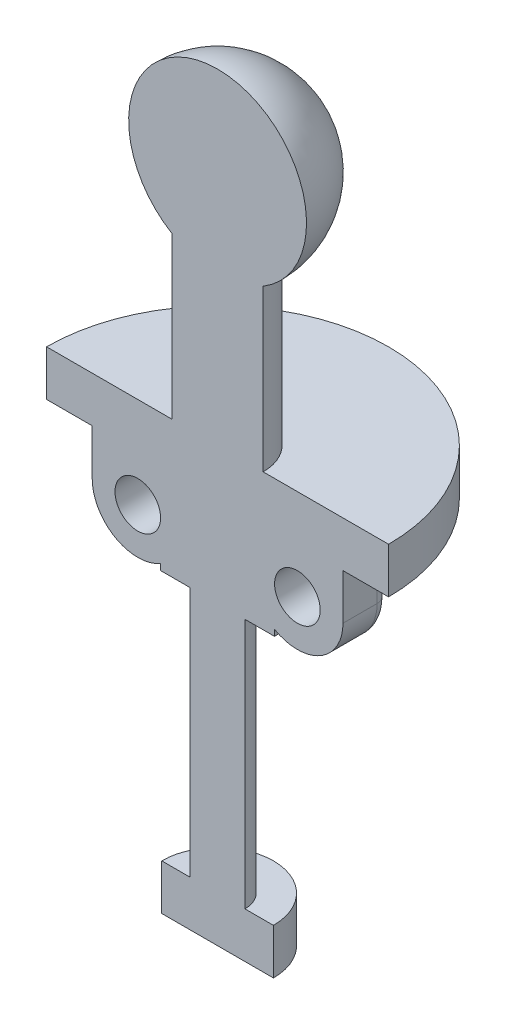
ISO-10303-21;
HEADER;
FILE_DESCRIPTION(('STEP AP214'),'2;1');
FILE_NAME('part.step','',(''),(''),'','','');
FILE_SCHEMA(('AUTOMOTIVE_DESIGN { 1 0 10303 214 1 1 1 1 }'));
ENDSEC;
DATA;
#1=APPLICATION_CONTEXT('core data for automotive mechanical design processes');
#2=APPLICATION_PROTOCOL_DEFINITION('international standard','automotive_design',2000,#1);
#3=PRODUCT_CONTEXT('',#1,'mechanical');
#4=PRODUCT('Part','Part','',(#3));
#5=PRODUCT_RELATED_PRODUCT_CATEGORY('part','',(#4));
#6=PRODUCT_DEFINITION_FORMATION('','',#4);
#7=PRODUCT_DEFINITION_CONTEXT('part definition',#1,'design');
#8=PRODUCT_DEFINITION('design','',#6,#7);
#9=PRODUCT_DEFINITION_SHAPE('','',#8);
#10=(LENGTH_UNIT() NAMED_UNIT(*) SI_UNIT(.MILLI.,.METRE.));
#11=(NAMED_UNIT(*) PLANE_ANGLE_UNIT() SI_UNIT($,.RADIAN.));
#12=(NAMED_UNIT(*) SI_UNIT($,.STERADIAN.) SOLID_ANGLE_UNIT());
#13=UNCERTAINTY_MEASURE_WITH_UNIT(LENGTH_MEASURE(1.E-05),#10,'distance_accuracy_value','');
#14=(GEOMETRIC_REPRESENTATION_CONTEXT(3) GLOBAL_UNCERTAINTY_ASSIGNED_CONTEXT((#13)) GLOBAL_UNIT_ASSIGNED_CONTEXT((#10,
#11,#12)) REPRESENTATION_CONTEXT('',''));
#15=CARTESIAN_POINT('',(0.,0.,0.));
#16=DIRECTION('',(0.,0.,1.));
#17=DIRECTION('',(1.,0.,0.));
#18=AXIS2_PLACEMENT_3D('',#15,#16,#17);
#19=CARTESIAN_POINT('',(0.,0.,0.));
#20=DIRECTION('',(0.,0.,1.));
#21=DIRECTION('',(1.,0.,0.));
#22=AXIS2_PLACEMENT_3D('',#19,#20,#21);
#23=PLANE('',#22);
#24=CARTESIAN_POINT('',(-3.5,-4.,0.));
#25=DIRECTION('',(0.,0.,1.));
#26=DIRECTION('',(1.,0.,0.));
#27=AXIS2_PLACEMENT_3D('',#24,#25,#26);
#28=CIRCLE('',#27,2.);
#29=CARTESIAN_POINT('',(-5.5,-4.,0.));
#30=VERTEX_POINT('',#29);
#31=CARTESIAN_POINT('',(-2.5,-5.73205080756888,0.));
#32=VERTEX_POINT('',#31);
#33=EDGE_CURVE('E254',#30,#32,#28,.T.);
#34=ORIENTED_EDGE('',*,*,#33,.T.);
#35=DIRECTION('',(0.,1.,0.));
#36=VECTOR('',#35,1.);
#37=CARTESIAN_POINT('',(-2.5,-2.,0.));
#38=LINE('',#37,#36);
#39=CARTESIAN_POINT('',(-2.5,-6.,0.));
#40=VERTEX_POINT('',#39);
#41=EDGE_CURVE('E558',#32,#40,#38,.F.);
#42=ORIENTED_EDGE('',*,*,#41,.T.);
#43=DIRECTION('',(1.,0.,0.));
#44=VECTOR('',#43,1.);
#45=CARTESIAN_POINT('',(0.,-6.,0.));
#46=LINE('',#45,#44);
#47=CARTESIAN_POINT('',(-1.2,-6.,0.));
#48=VERTEX_POINT('',#47);
#49=EDGE_CURVE('E566',#40,#48,#46,.T.);
#50=ORIENTED_EDGE('',*,*,#49,.T.);
#51=DIRECTION('',(0.,1.,0.));
#52=VECTOR('',#51,1.);
#53=CARTESIAN_POINT('',(-1.2,-2.,0.));
#54=LINE('',#53,#52);
#55=CARTESIAN_POINT('',(-1.2,-17.,0.));
#56=VERTEX_POINT('',#55);
#57=EDGE_CURVE('E574',#48,#56,#54,.F.);
#58=ORIENTED_EDGE('',*,*,#57,.T.);
#59=DIRECTION('',(-1.,0.,0.));
#60=VECTOR('',#59,1.);
#61=CARTESIAN_POINT('',(0.,-17.,0.));
#62=LINE('',#61,#60);
#63=CARTESIAN_POINT('',(-2.45,-17.,0.));
#64=VERTEX_POINT('',#63);
#65=EDGE_CURVE('E579',#56,#64,#62,.T.);
#66=ORIENTED_EDGE('',*,*,#65,.T.);
#67=DIRECTION('',(0.,1.,0.));
#68=VECTOR('',#67,1.);
#69=CARTESIAN_POINT('',(-2.45,-2.,0.));
#70=LINE('',#69,#68);
#71=CARTESIAN_POINT('',(-2.45,-19.,0.));
#72=VERTEX_POINT('',#71);
#73=EDGE_CURVE('E587',#64,#72,#70,.F.);
#74=ORIENTED_EDGE('',*,*,#73,.T.);
#75=DIRECTION('',(1.,0.,0.));
#76=VECTOR('',#75,1.);
#77=CARTESIAN_POINT('',(0.,-19.,0.));
#78=LINE('',#77,#76);
#79=CARTESIAN_POINT('',(2.45,-19.,0.));
#80=VERTEX_POINT('',#79);
#81=EDGE_CURVE('E263',#72,#80,#78,.T.);
#82=ORIENTED_EDGE('',*,*,#81,.T.);
#83=DIRECTION('',(0.,1.,0.));
#84=VECTOR('',#83,1.);
#85=CARTESIAN_POINT('',(2.45,-2.,0.));
#86=LINE('',#85,#84);
#87=CARTESIAN_POINT('',(2.45,-17.,0.));
#88=VERTEX_POINT('',#87);
#89=EDGE_CURVE('E583',#80,#88,#86,.T.);
#90=ORIENTED_EDGE('',*,*,#89,.T.);
#91=CARTESIAN_POINT('',(1.2,-17.,0.));
#92=VERTEX_POINT('',#91);
#93=EDGE_CURVE('E578',#88,#92,#62,.T.);
#94=ORIENTED_EDGE('',*,*,#93,.T.);
#95=DIRECTION('',(0.,1.,0.));
#96=VECTOR('',#95,1.);
#97=CARTESIAN_POINT('',(1.2,-2.,0.));
#98=LINE('',#97,#96);
#99=CARTESIAN_POINT('',(1.2,-6.,0.));
#100=VERTEX_POINT('',#99);
#101=EDGE_CURVE('E570',#92,#100,#98,.T.);
#102=ORIENTED_EDGE('',*,*,#101,.T.);
#103=CARTESIAN_POINT('',(2.5,-6.,0.));
#104=VERTEX_POINT('',#103);
#105=EDGE_CURVE('E567',#100,#104,#46,.T.);
#106=ORIENTED_EDGE('',*,*,#105,.T.);
#107=DIRECTION('',(0.,1.,0.));
#108=VECTOR('',#107,1.);
#109=CARTESIAN_POINT('',(2.5,-2.,0.));
#110=LINE('',#109,#108);
#111=CARTESIAN_POINT('',(2.5,-5.73205080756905,0.));
#112=VERTEX_POINT('',#111);
#113=EDGE_CURVE('E251',#104,#112,#110,.T.);
#114=ORIENTED_EDGE('',*,*,#113,.T.);
#115=CARTESIAN_POINT('',(3.5,-4.,0.));
#116=DIRECTION('',(0.,0.,1.));
#117=DIRECTION('',(1.,0.,0.));
#118=AXIS2_PLACEMENT_3D('',#115,#116,#117);
#119=CIRCLE('',#118,2.);
#120=CARTESIAN_POINT('',(5.5,-4.,0.));
#121=VERTEX_POINT('',#120);
#122=EDGE_CURVE('E233',#121,#112,#119,.F.);
#123=ORIENTED_EDGE('',*,*,#122,.F.);
#124=DIRECTION('',(0.,1.,0.));
#125=VECTOR('',#124,1.);
#126=CARTESIAN_POINT('',(5.5,0.,0.));
#127=LINE('',#126,#125);
#128=CARTESIAN_POINT('',(5.5,-2.,0.));
#129=VERTEX_POINT('',#128);
#130=EDGE_CURVE('E248',#121,#129,#127,.T.);
#131=ORIENTED_EDGE('',*,*,#130,.T.);
#132=DIRECTION('',(1.,0.,0.));
#133=VECTOR('',#132,1.);
#134=CARTESIAN_POINT('',(0.,-2.,0.));
#135=LINE('',#134,#133);
#136=CARTESIAN_POINT('',(7.5,-2.,0.));
#137=VERTEX_POINT('',#136);
#138=EDGE_CURVE('E563',#129,#137,#135,.T.);
#139=ORIENTED_EDGE('',*,*,#138,.T.);
#140=DIRECTION('',(0.,1.,0.));
#141=VECTOR('',#140,1.);
#142=CARTESIAN_POINT('',(7.5,-2.,0.));
#143=LINE('',#142,#141);
#144=CARTESIAN_POINT('',(7.5,0.,0.));
#145=VERTEX_POINT('',#144);
#146=EDGE_CURVE('E253',#145,#137,#143,.F.);
#147=ORIENTED_EDGE('',*,*,#146,.F.);
#148=DIRECTION('',(1.,0.,0.));
#149=VECTOR('',#148,1.);
#150=CARTESIAN_POINT('',(0.,0.,0.));
#151=LINE('',#150,#149);
#152=CARTESIAN_POINT('',(2.,0.,0.));
#153=VERTEX_POINT('',#152);
#154=EDGE_CURVE('E543',#153,#145,#151,.T.);
#155=ORIENTED_EDGE('',*,*,#154,.F.);
#156=DIRECTION('',(0.,-1.,0.));
#157=VECTOR('',#156,1.);
#158=CARTESIAN_POINT('',(2.,0.,0.));
#159=LINE('',#158,#157);
#160=CARTESIAN_POINT('',(2.,7.05186619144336,0.));
#161=VERTEX_POINT('',#160);
#162=EDGE_CURVE('E531',#161,#153,#159,.T.);
#163=ORIENTED_EDGE('',*,*,#162,.F.);
#164=CARTESIAN_POINT('',(0.,10.4,0.));
#165=DIRECTION('',(0.,0.,1.));
#166=DIRECTION('',(1.,0.,0.));
#167=AXIS2_PLACEMENT_3D('',#164,#165,#166);
#168=CIRCLE('',#167,3.9);
#169=CARTESIAN_POINT('',(-2.,7.05186619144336,0.));
#170=VERTEX_POINT('',#169);
#171=EDGE_CURVE('E259',#161,#170,#168,.T.);
#172=ORIENTED_EDGE('',*,*,#171,.T.);
#173=DIRECTION('',(0.,-1.,0.));
#174=VECTOR('',#173,1.);
#175=CARTESIAN_POINT('',(-2.,0.,0.));
#176=LINE('',#175,#174);
#177=CARTESIAN_POINT('',(-2.,0.,0.));
#178=VERTEX_POINT('',#177);
#179=EDGE_CURVE('E537',#178,#170,#176,.F.);
#180=ORIENTED_EDGE('',*,*,#179,.F.);
#181=CARTESIAN_POINT('',(-7.5,0.,0.));
#182=VERTEX_POINT('',#181);
#183=EDGE_CURVE('E544',#182,#178,#151,.T.);
#184=ORIENTED_EDGE('',*,*,#183,.F.);
#185=DIRECTION('',(0.,1.,0.));
#186=VECTOR('',#185,1.);
#187=CARTESIAN_POINT('',(-7.5,-2.,0.));
#188=LINE('',#187,#186);
#189=CARTESIAN_POINT('',(-7.5,-2.,0.));
#190=VERTEX_POINT('',#189);
#191=EDGE_CURVE('E548',#190,#182,#188,.T.);
#192=ORIENTED_EDGE('',*,*,#191,.F.);
#193=CARTESIAN_POINT('',(-5.5,-2.,0.));
#194=VERTEX_POINT('',#193);
#195=EDGE_CURVE('E562',#190,#194,#135,.T.);
#196=ORIENTED_EDGE('',*,*,#195,.T.);
#197=DIRECTION('',(0.,1.,0.));
#198=VECTOR('',#197,1.);
#199=CARTESIAN_POINT('',(-5.5,0.,0.));
#200=LINE('',#199,#198);
#201=EDGE_CURVE('E523',#30,#194,#200,.T.);
#202=ORIENTED_EDGE('',*,*,#201,.F.);
#203=EDGE_LOOP('',(#34,#42,#50,#58,#66,#74,#82,#90,#94,#102,#106,#114,#123,#131,#139,#147,#155,
#163,#172,#180,#184,#192,#196,#202));
#204=FACE_BOUND('',#203,.T.);
#205=CARTESIAN_POINT('',(-3.5,-4.,0.));
#206=DIRECTION('',(0.,0.,1.));
#207=DIRECTION('',(1.,0.,0.));
#208=AXIS2_PLACEMENT_3D('',#205,#206,#207);
#209=CIRCLE('',#208,1.);
#210=CARTESIAN_POINT('',(-2.5,-4.,0.));
#211=VERTEX_POINT('',#210);
#212=EDGE_CURVE('E57',#211,#211,#209,.T.);
#213=ORIENTED_EDGE('',*,*,#212,.F.);
#214=EDGE_LOOP('',(#213));
#215=FACE_BOUND('',#214,.T.);
#216=CARTESIAN_POINT('',(3.5,-4.,0.));
#217=DIRECTION('',(0.,0.,-1.));
#218=DIRECTION('',(-1.,0.,0.));
#219=AXIS2_PLACEMENT_3D('',#216,#217,#218);
#220=CIRCLE('',#219,1.);
#221=CARTESIAN_POINT('',(2.5,-4.,0.));
#222=VERTEX_POINT('',#221);
#223=EDGE_CURVE('E11',#222,#222,#220,.T.);
#224=ORIENTED_EDGE('',*,*,#223,.T.);
#225=EDGE_LOOP('',(#224));
#226=FACE_BOUND('',#225,.T.);
#227=ADVANCED_FACE('F47',(#204,#215,#226),#23,.T.);
#228=CARTESIAN_POINT('',(3.5,-4.,2.));
#229=DIRECTION('',(0.,0.,-1.));
#230=DIRECTION('',(-1.,0.,0.));
#231=AXIS2_PLACEMENT_3D('',#228,#229,#230);
#232=CYLINDRICAL_SURFACE('',#231,2.);
#233=DIRECTION('',(0.,0.,1.));
#234=VECTOR('',#233,1.);
#235=CARTESIAN_POINT('',(1.5,-4.,-2.));
#236=LINE('',#235,#234);
#237=CARTESIAN_POINT('',(1.5,-4.,-1.5));
#238=VERTEX_POINT('',#237);
#239=CARTESIAN_POINT('',(1.5,-4.,-1.3228756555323));
#240=VERTEX_POINT('',#239);
#241=EDGE_CURVE('E65',#238,#240,#236,.T.);
#242=ORIENTED_EDGE('',*,*,#241,.F.);
#243=CARTESIAN_POINT('',(3.5,-4.,-1.5));
#244=DIRECTION('',(0.,0.,-1.));
#245=DIRECTION('',(-1.,0.,0.));
#246=AXIS2_PLACEMENT_3D('',#243,#244,#245);
#247=CIRCLE('',#246,2.);
#248=CARTESIAN_POINT('',(1.56350832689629,-4.5,-1.5));
#249=VERTEX_POINT('',#248);
#250=EDGE_CURVE('E403',#238,#249,#247,.F.);
#251=ORIENTED_EDGE('',*,*,#250,.T.);
#252=DIRECTION('',(0.,0.,1.));
#253=VECTOR('',#252,1.);
#254=CARTESIAN_POINT('',(1.56350832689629,-4.5,-2.));
#255=LINE('',#254,#253);
#256=CARTESIAN_POINT('',(1.56350832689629,-4.5,-1.24717348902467));
#257=VERTEX_POINT('',#256);
#258=EDGE_CURVE('E72',#249,#257,#255,.T.);
#259=ORIENTED_EDGE('',*,*,#258,.T.);
#260=CARTESIAN_POINT('',(2.,-5.3228756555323,0.));
#261=CARTESIAN_POINT('',(1.99999605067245,-5.3228763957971,0.0718772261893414));
#262=CARTESIAN_POINT('',(1.99609720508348,-5.31849077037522,0.143820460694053));
#263=CARTESIAN_POINT('',(1.98075710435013,-5.30078205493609,0.285865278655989));
#264=CARTESIAN_POINT('',(1.96930424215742,-5.28744521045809,0.355963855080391));
#265=CARTESIAN_POINT('',(1.93970719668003,-5.25141077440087,0.492345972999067));
#266=CARTESIAN_POINT('',(1.92155581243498,-5.22870310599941,0.5586253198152));
#267=CARTESIAN_POINT('',(1.8801317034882,-5.17354527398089,0.685228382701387));
#268=CARTESIAN_POINT('',(1.85686264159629,-5.14110207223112,0.745556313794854));
#269=CARTESIAN_POINT('',(1.80791353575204,-5.06712869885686,0.857383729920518));
#270=CARTESIAN_POINT('',(1.78228862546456,-5.0257857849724,0.909031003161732));
#271=CARTESIAN_POINT('',(1.73081520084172,-4.93420275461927,1.0035853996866));
#272=CARTESIAN_POINT('',(1.70496670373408,-4.88396331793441,1.04649319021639));
#273=CARTESIAN_POINT('',(1.65645697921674,-4.77759210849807,1.12164714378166));
#274=CARTESIAN_POINT('',(1.63371842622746,-4.72171133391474,1.15419997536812));
#275=CARTESIAN_POINT('',(1.59244915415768,-4.60425581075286,1.21050777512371));
#276=CARTESIAN_POINT('',(1.57391929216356,-4.54267990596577,1.23426095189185));
#277=CARTESIAN_POINT('',(1.54215515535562,-4.41394172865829,1.27374236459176));
#278=CARTESIAN_POINT('',(1.52906427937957,-4.34667851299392,1.28925597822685));
#279=CARTESIAN_POINT('',(1.50982880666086,-4.20976736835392,1.31173014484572));
#280=CARTESIAN_POINT('',(1.50368625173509,-4.14011874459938,1.31868818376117));
#281=CARTESIAN_POINT('',(1.49866160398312,-3.99694974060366,1.32439858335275));
#282=CARTESIAN_POINT('',(1.50013243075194,-3.9234006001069,1.32275204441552));
#283=CARTESIAN_POINT('',(1.51105256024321,-3.77767662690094,1.31026237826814));
#284=CARTESIAN_POINT('',(1.52050279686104,-3.70550195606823,1.29941817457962));
#285=CARTESIAN_POINT('',(1.5467860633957,-3.56389313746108,1.26802005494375));
#286=CARTESIAN_POINT('',(1.5636917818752,-3.49449349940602,1.24737038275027));
#287=CARTESIAN_POINT('',(1.60341707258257,-3.36141495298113,1.19586957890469));
#288=CARTESIAN_POINT('',(1.62623402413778,-3.29773352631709,1.16502296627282));
#289=CARTESIAN_POINT('',(1.67456545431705,-3.18045133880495,1.09434119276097));
#290=CARTESIAN_POINT('',(1.69994086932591,-3.12655525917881,1.05490135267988));
#291=CARTESIAN_POINT('',(1.75152950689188,-3.02738474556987,0.966818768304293));
#292=CARTESIAN_POINT('',(1.77774250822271,-2.98210805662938,0.918178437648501));
#293=CARTESIAN_POINT('',(1.82735351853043,-2.90255989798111,0.814821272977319));
#294=CARTESIAN_POINT('',(1.85082119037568,-2.86793051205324,0.760412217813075));
#295=CARTESIAN_POINT('',(1.89395718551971,-2.80751960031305,0.645516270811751));
#296=CARTESIAN_POINT('',(1.91362474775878,-2.78173984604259,0.585028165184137));
#297=CARTESIAN_POINT('',(1.94786062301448,-2.73839597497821,0.458490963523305));
#298=CARTESIAN_POINT('',(1.96232790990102,-2.72099260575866,0.392359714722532));
#299=CARTESIAN_POINT('',(1.98455762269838,-2.69472953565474,0.257328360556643));
#300=CARTESIAN_POINT('',(1.99231811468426,-2.6858722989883,0.18842746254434));
#301=CARTESIAN_POINT('',(2.00078972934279,-2.67621186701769,0.0463075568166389));
#302=CARTESIAN_POINT('',(2.00114637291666,-2.67581364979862,-0.0269604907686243));
#303=CARTESIAN_POINT('',(1.99387278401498,-2.68409352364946,-0.172593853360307));
#304=CARTESIAN_POINT('',(1.98624123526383,-2.69277311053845,-0.244959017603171));
#305=CARTESIAN_POINT('',(1.96338117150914,-2.71971909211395,-0.387879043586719));
#306=CARTESIAN_POINT('',(1.94803423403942,-2.73813516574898,-0.458387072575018));
#307=CARTESIAN_POINT('',(1.91099962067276,-2.78510653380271,-0.594161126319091));
#308=CARTESIAN_POINT('',(1.88931444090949,-2.81365783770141,-0.659429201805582));
#309=CARTESIAN_POINT('',(1.84252592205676,-2.88001710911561,-0.780491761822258));
#310=CARTESIAN_POINT('',(1.81756675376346,-2.91747074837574,-0.836535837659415));
#311=CARTESIAN_POINT('',(1.76618563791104,-3.00184371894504,-0.940179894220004));
#312=CARTESIAN_POINT('',(1.73976417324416,-3.04875993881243,-0.987782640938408));
#313=CARTESIAN_POINT('',(1.68928600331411,-3.14892941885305,-1.07173636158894));
#314=CARTESIAN_POINT('',(1.66517651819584,-3.20182849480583,-1.10847963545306));
#315=CARTESIAN_POINT('',(1.62032511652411,-3.3140886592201,-1.17307225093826));
#316=CARTESIAN_POINT('',(1.59958378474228,-3.37345086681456,-1.20092004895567));
#317=CARTESIAN_POINT('',(1.56300757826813,-3.4977021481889,-1.2481646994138));
#318=CARTESIAN_POINT('',(1.54723260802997,-3.56264749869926,-1.26745943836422));
#319=CARTESIAN_POINT('',(1.52212729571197,-3.69568651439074,-1.29750250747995));
#320=CARTESIAN_POINT('',(1.51279878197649,-3.76378106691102,-1.30824841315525));
#321=CARTESIAN_POINT('',(1.50096484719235,-3.90466152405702,-1.32181418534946));
#322=CARTESIAN_POINT('',(1.49880767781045,-3.97751590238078,-1.32422971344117));
#323=CARTESIAN_POINT('',(1.50244997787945,-4.12278197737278,-1.32009486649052));
#324=CARTESIAN_POINT('',(1.50825106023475,-4.19519358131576,-1.3135426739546));
#325=CARTESIAN_POINT('',(1.52759429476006,-4.33910984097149,-1.29100010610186));
#326=CARTESIAN_POINT('',(1.54129982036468,-4.41056172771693,-1.27481030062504));
#327=CARTESIAN_POINT('',(1.57543038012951,-4.54871699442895,-1.23237793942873));
#328=CARTESIAN_POINT('',(1.59585325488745,-4.61542189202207,-1.20613861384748));
#329=CARTESIAN_POINT('',(1.64081262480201,-4.74005592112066,-1.14417962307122));
#330=CARTESIAN_POINT('',(1.66520861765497,-4.79818713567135,-1.10876531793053));
#331=CARTESIAN_POINT('',(1.71609081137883,-4.90622073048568,-1.02824525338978));
#332=CARTESIAN_POINT('',(1.74257604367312,-4.95612689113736,-0.983143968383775));
#333=CARTESIAN_POINT('',(1.79368550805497,-5.04450316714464,-0.886310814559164));
#334=CARTESIAN_POINT('',(1.81833958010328,-5.0833903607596,-0.834974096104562));
#335=CARTESIAN_POINT('',(1.86474651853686,-5.15224873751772,-0.725435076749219));
#336=CARTESIAN_POINT('',(1.88649795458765,-5.1822155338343,-0.667229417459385));
#337=CARTESIAN_POINT('',(1.92529767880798,-5.23343199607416,-0.54529447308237));
#338=CARTESIAN_POINT('',(1.94232160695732,-5.25463677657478,-0.481538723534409));
#339=CARTESIAN_POINT('',(1.97017154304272,-5.28845217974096,-0.350565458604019));
#340=CARTESIAN_POINT('',(1.98100516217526,-5.30107335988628,-0.283352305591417));
#341=CARTESIAN_POINT('',(1.99223052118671,-5.31402447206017,-0.179736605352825));
#342=CARTESIAN_POINT('',(1.9951380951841,-5.31734569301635,-0.143936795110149));
#343=CARTESIAN_POINT('',(1.99902382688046,-5.32177110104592,-0.072096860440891));
#344=CARTESIAN_POINT('',(2.00000198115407,-5.32287528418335,-0.036056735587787));
#345=CARTESIAN_POINT('',(2.,-5.3228756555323,0.));
#346=B_SPLINE_CURVE_WITH_KNOTS('',3,(#260,#261,#262,#263,#264,#265,#266,#267,#268,#269,#270,
#271,#272,#273,#274,#275,#276,#277,#278,#279,#280,#281,#282,#283,#284,#285,#286,#287,#288,#289,
#290,#291,#292,#293,#294,#295,#296,#297,#298,#299,#300,#301,#302,#303,#304,#305,#306,#307,#308,
#309,#310,#311,#312,#313,#314,#315,#316,#317,#318,#319,#320,#321,#322,#323,#324,#325,#326,#327,
#328,#329,#330,#331,#332,#333,#334,#335,#336,#337,#338,#339,#340,#341,#342,#343,#344,#345),
.UNSPECIFIED.,.T.,.F.,(4,2,2,2,2,2,2,2,2,2,2,2,2,2,2,2,2,2,2,2,2,2,2,2,2,2,2,2,2,2,2,2,2,2,2,2,
2,2,2,2,2,2,4),(0.,0.215506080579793,0.431344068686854,0.647414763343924,0.863331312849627,
1.07508496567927,1.28682244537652,1.49153031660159,1.69627983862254,1.90612927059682,
2.11604035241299,2.33576660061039,2.55551856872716,2.77746211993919,2.99930744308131,
3.21254268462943,3.42572206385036,3.63065638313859,3.83563170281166,4.04439761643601,
4.25322370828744,4.47202599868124,4.69086434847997,4.91316913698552,5.13538649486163,
5.34991775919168,5.56437859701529,5.76972240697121,5.97510183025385,6.1828712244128,
6.39069952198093,6.60848338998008,6.8263114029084,7.04881172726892,7.27124059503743,
7.48705025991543,7.70276045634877,7.90865407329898,8.11464877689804,8.32168603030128,
8.52846817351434,8.63657518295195,8.74468238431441),.UNSPECIFIED.);
#347=EDGE_CURVE('E449',#240,#257,#346,.T.);
#348=ORIENTED_EDGE('',*,*,#347,.F.);
#349=EDGE_LOOP('',(#242,#251,#259,#348));
#350=FACE_BOUND('',#349,.T.);
#351=ADVANCED_FACE('F290',(#350),#232,.T.);
#352=CARTESIAN_POINT('',(-3.5,-4.,2.));
#353=DIRECTION('',(0.,0.,-1.));
#354=DIRECTION('',(-1.,0.,0.));
#355=AXIS2_PLACEMENT_3D('',#352,#353,#354);
#356=CYLINDRICAL_SURFACE('',#355,2.);
#357=DIRECTION('',(0.,0.,1.));
#358=VECTOR('',#357,1.);
#359=CARTESIAN_POINT('',(-1.56350832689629,-4.5,-2.));
#360=LINE('',#359,#358);
#361=CARTESIAN_POINT('',(-1.56350832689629,-4.5,-1.5));
#362=VERTEX_POINT('',#361);
#363=CARTESIAN_POINT('',(-1.56350832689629,-4.5,-1.24717348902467));
#364=VERTEX_POINT('',#363);
#365=EDGE_CURVE('E465',#362,#364,#360,.T.);
#366=ORIENTED_EDGE('',*,*,#365,.F.);
#367=CARTESIAN_POINT('',(-3.5,-4.,-1.5));
#368=DIRECTION('',(0.,0.,-1.));
#369=DIRECTION('',(-1.,0.,0.));
#370=AXIS2_PLACEMENT_3D('',#367,#368,#369);
#371=CIRCLE('',#370,2.);
#372=CARTESIAN_POINT('',(-1.5,-4.,-1.5));
#373=VERTEX_POINT('',#372);
#374=EDGE_CURVE('E387',#362,#373,#371,.F.);
#375=ORIENTED_EDGE('',*,*,#374,.T.);
#376=DIRECTION('',(0.,0.,1.));
#377=VECTOR('',#376,1.);
#378=CARTESIAN_POINT('',(-1.5,-4.,-2.));
#379=LINE('',#378,#377);
#380=CARTESIAN_POINT('',(-1.5,-4.,-1.3228756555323));
#381=VERTEX_POINT('',#380);
#382=EDGE_CURVE('E963',#373,#381,#379,.T.);
#383=ORIENTED_EDGE('',*,*,#382,.T.);
#384=CARTESIAN_POINT('',(-2.,-5.3228756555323,0.));
#385=CARTESIAN_POINT('',(-1.99999605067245,-5.3228763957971,0.0718772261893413));
#386=CARTESIAN_POINT('',(-1.99609720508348,-5.31849077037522,0.143820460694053));
#387=CARTESIAN_POINT('',(-1.98075710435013,-5.30078205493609,0.285865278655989));
#388=CARTESIAN_POINT('',(-1.96930424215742,-5.28744521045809,0.355963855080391));
#389=CARTESIAN_POINT('',(-1.93970719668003,-5.25141077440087,0.492345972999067));
#390=CARTESIAN_POINT('',(-1.92155581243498,-5.22870310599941,0.5586253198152));
#391=CARTESIAN_POINT('',(-1.8801317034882,-5.17354527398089,0.685228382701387));
#392=CARTESIAN_POINT('',(-1.85686264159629,-5.14110207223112,0.745556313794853));
#393=CARTESIAN_POINT('',(-1.80791353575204,-5.06712869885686,0.857383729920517));
#394=CARTESIAN_POINT('',(-1.78228862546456,-5.0257857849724,0.909031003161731));
#395=CARTESIAN_POINT('',(-1.73081520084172,-4.93420275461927,1.0035853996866));
#396=CARTESIAN_POINT('',(-1.70496670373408,-4.8839633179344,1.04649319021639));
#397=CARTESIAN_POINT('',(-1.65645697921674,-4.77759210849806,1.12164714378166));
#398=CARTESIAN_POINT('',(-1.63371842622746,-4.72171133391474,1.15419997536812));
#399=CARTESIAN_POINT('',(-1.59244915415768,-4.60425581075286,1.21050777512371));
#400=CARTESIAN_POINT('',(-1.57391929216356,-4.54267990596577,1.23426095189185));
#401=CARTESIAN_POINT('',(-1.54215515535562,-4.41394172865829,1.27374236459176));
#402=CARTESIAN_POINT('',(-1.52906427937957,-4.34667851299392,1.28925597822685));
#403=CARTESIAN_POINT('',(-1.50982880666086,-4.20976736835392,1.31173014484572));
#404=CARTESIAN_POINT('',(-1.50368625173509,-4.14011874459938,1.31868818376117));
#405=CARTESIAN_POINT('',(-1.49866160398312,-3.99694974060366,1.32439858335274));
#406=CARTESIAN_POINT('',(-1.50013243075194,-3.9234006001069,1.32275204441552));
#407=CARTESIAN_POINT('',(-1.51105256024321,-3.77767662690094,1.31026237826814));
#408=CARTESIAN_POINT('',(-1.52050279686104,-3.70550195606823,1.29941817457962));
#409=CARTESIAN_POINT('',(-1.5467860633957,-3.56389313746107,1.26802005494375));
#410=CARTESIAN_POINT('',(-1.5636917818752,-3.49449349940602,1.24737038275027));
#411=CARTESIAN_POINT('',(-1.60341707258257,-3.36141495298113,1.19586957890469));
#412=CARTESIAN_POINT('',(-1.62623402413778,-3.29773352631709,1.16502296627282));
#413=CARTESIAN_POINT('',(-1.67456545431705,-3.18045133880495,1.09434119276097));
#414=CARTESIAN_POINT('',(-1.69994086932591,-3.12655525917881,1.05490135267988));
#415=CARTESIAN_POINT('',(-1.75152950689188,-3.02738474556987,0.966818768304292));
#416=CARTESIAN_POINT('',(-1.77774250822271,-2.98210805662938,0.918178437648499));
#417=CARTESIAN_POINT('',(-1.82735351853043,-2.90255989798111,0.814821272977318));
#418=CARTESIAN_POINT('',(-1.85082119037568,-2.86793051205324,0.760412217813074));
#419=CARTESIAN_POINT('',(-1.89395718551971,-2.80751960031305,0.64551627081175));
#420=CARTESIAN_POINT('',(-1.91362474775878,-2.78173984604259,0.585028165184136));
#421=CARTESIAN_POINT('',(-1.94786062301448,-2.73839597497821,0.458490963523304));
#422=CARTESIAN_POINT('',(-1.96232790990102,-2.72099260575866,0.392359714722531));
#423=CARTESIAN_POINT('',(-1.98455762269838,-2.69472953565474,0.257328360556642));
#424=CARTESIAN_POINT('',(-1.99231811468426,-2.6858722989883,0.18842746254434));
#425=CARTESIAN_POINT('',(-2.00078972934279,-2.67621186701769,0.0463075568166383));
#426=CARTESIAN_POINT('',(-2.00114637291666,-2.67581364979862,-0.026960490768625));
#427=CARTESIAN_POINT('',(-1.99387278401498,-2.68409352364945,-0.172593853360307));
#428=CARTESIAN_POINT('',(-1.98624123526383,-2.69277311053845,-0.244959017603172));
#429=CARTESIAN_POINT('',(-1.96338117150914,-2.71971909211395,-0.387879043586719));
#430=CARTESIAN_POINT('',(-1.94803423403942,-2.73813516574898,-0.458387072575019));
#431=CARTESIAN_POINT('',(-1.91099962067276,-2.78510653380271,-0.594161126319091));
#432=CARTESIAN_POINT('',(-1.88931444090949,-2.81365783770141,-0.659429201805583));
#433=CARTESIAN_POINT('',(-1.84252592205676,-2.88001710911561,-0.780491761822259));
#434=CARTESIAN_POINT('',(-1.81756675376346,-2.91747074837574,-0.836535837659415));
#435=CARTESIAN_POINT('',(-1.76618563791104,-3.00184371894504,-0.940179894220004));
#436=CARTESIAN_POINT('',(-1.73976417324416,-3.04875993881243,-0.987782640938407));
#437=CARTESIAN_POINT('',(-1.68928600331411,-3.14892941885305,-1.07173636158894));
#438=CARTESIAN_POINT('',(-1.66517651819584,-3.20182849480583,-1.10847963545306));
#439=CARTESIAN_POINT('',(-1.62032511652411,-3.3140886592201,-1.17307225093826));
#440=CARTESIAN_POINT('',(-1.59958378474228,-3.37345086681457,-1.20092004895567));
#441=CARTESIAN_POINT('',(-1.56300757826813,-3.4977021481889,-1.2481646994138));
#442=CARTESIAN_POINT('',(-1.54723260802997,-3.56264749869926,-1.26745943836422));
#443=CARTESIAN_POINT('',(-1.52212729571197,-3.69568651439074,-1.29750250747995));
#444=CARTESIAN_POINT('',(-1.51279878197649,-3.76378106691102,-1.30824841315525));
#445=CARTESIAN_POINT('',(-1.50096484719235,-3.90466152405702,-1.32181418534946));
#446=CARTESIAN_POINT('',(-1.49880767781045,-3.97751590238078,-1.32422971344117));
#447=CARTESIAN_POINT('',(-1.50244997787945,-4.12278197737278,-1.32009486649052));
#448=CARTESIAN_POINT('',(-1.50825106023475,-4.19519358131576,-1.3135426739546));
#449=CARTESIAN_POINT('',(-1.52759429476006,-4.33910984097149,-1.29100010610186));
#450=CARTESIAN_POINT('',(-1.54129982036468,-4.41056172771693,-1.27481030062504));
#451=CARTESIAN_POINT('',(-1.57543038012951,-4.54871699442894,-1.23237793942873));
#452=CARTESIAN_POINT('',(-1.59585325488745,-4.61542189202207,-1.20613861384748));
#453=CARTESIAN_POINT('',(-1.64081262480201,-4.74005592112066,-1.14417962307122));
#454=CARTESIAN_POINT('',(-1.66520861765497,-4.79818713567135,-1.10876531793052));
#455=CARTESIAN_POINT('',(-1.71609081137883,-4.90622073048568,-1.02824525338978));
#456=CARTESIAN_POINT('',(-1.74257604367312,-4.95612689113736,-0.983143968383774));
#457=CARTESIAN_POINT('',(-1.79368550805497,-5.04450316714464,-0.886310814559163));
#458=CARTESIAN_POINT('',(-1.81833958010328,-5.0833903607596,-0.83497409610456));
#459=CARTESIAN_POINT('',(-1.86474651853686,-5.15224873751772,-0.725435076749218));
#460=CARTESIAN_POINT('',(-1.88649795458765,-5.1822155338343,-0.667229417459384));
#461=CARTESIAN_POINT('',(-1.92529767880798,-5.23343199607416,-0.545294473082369));
#462=CARTESIAN_POINT('',(-1.94232160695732,-5.25463677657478,-0.481538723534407));
#463=CARTESIAN_POINT('',(-1.97017154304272,-5.28845217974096,-0.350565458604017));
#464=CARTESIAN_POINT('',(-1.98100516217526,-5.30107335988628,-0.283352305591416));
#465=CARTESIAN_POINT('',(-1.99223052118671,-5.31402447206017,-0.179736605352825));
#466=CARTESIAN_POINT('',(-1.9951380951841,-5.31734569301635,-0.14393679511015));
#467=CARTESIAN_POINT('',(-1.99902382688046,-5.32177110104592,-0.0720968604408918));
#468=CARTESIAN_POINT('',(-2.00000198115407,-5.32287528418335,-0.0360567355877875));
#469=CARTESIAN_POINT('',(-2.,-5.3228756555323,0.));
#470=B_SPLINE_CURVE_WITH_KNOTS('',3,(#384,#385,#386,#387,#388,#389,#390,#391,#392,#393,#394,
#395,#396,#397,#398,#399,#400,#401,#402,#403,#404,#405,#406,#407,#408,#409,#410,#411,#412,#413,
#414,#415,#416,#417,#418,#419,#420,#421,#422,#423,#424,#425,#426,#427,#428,#429,#430,#431,#432,
#433,#434,#435,#436,#437,#438,#439,#440,#441,#442,#443,#444,#445,#446,#447,#448,#449,#450,#451,
#452,#453,#454,#455,#456,#457,#458,#459,#460,#461,#462,#463,#464,#465,#466,#467,#468,#469),
.UNSPECIFIED.,.T.,.F.,(4,2,2,2,2,2,2,2,2,2,2,2,2,2,2,2,2,2,2,2,2,2,2,2,2,2,2,2,2,2,2,2,2,2,2,2,
2,2,2,2,2,2,4),(0.,0.215506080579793,0.431344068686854,0.647414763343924,0.863331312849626,
1.07508496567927,1.28682244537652,1.49153031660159,1.69627983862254,1.90612927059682,
2.11604035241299,2.33576660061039,2.55551856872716,2.77746211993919,2.99930744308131,
3.21254268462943,3.42572206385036,3.63065638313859,3.83563170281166,4.04439761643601,
4.25322370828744,4.47202599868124,4.69086434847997,4.91316913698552,5.13538649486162,
5.34991775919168,5.56437859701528,5.76972240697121,5.97510183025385,6.1828712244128,
6.39069952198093,6.60848338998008,6.8263114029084,7.04881172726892,7.27124059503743,
7.48705025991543,7.70276045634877,7.90865407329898,8.11464877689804,8.32168603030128,
8.52846817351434,8.63657518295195,8.7446823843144),.UNSPECIFIED.);
#471=EDGE_CURVE('E456',#381,#364,#470,.T.);
#472=ORIENTED_EDGE('',*,*,#471,.T.);
#473=EDGE_LOOP('',(#366,#375,#383,#472));
#474=FACE_BOUND('',#473,.T.);
#475=ADVANCED_FACE('F291',(#474),#356,.T.);
#476=CARTESIAN_POINT('',(-1.5,0.,-2.));
#477=DIRECTION('',(1.,0.,0.));
#478=DIRECTION('',(0.,0.,-1.));
#479=AXIS2_PLACEMENT_3D('',#476,#477,#478);
#480=PLANE('',#479);
#481=ORIENTED_EDGE('',*,*,#382,.F.);
#482=DIRECTION('',(0.,1.,0.));
#483=VECTOR('',#482,1.);
#484=CARTESIAN_POINT('',(-1.5,0.,-1.5));
#485=LINE('',#484,#483);
#486=CARTESIAN_POINT('',(-1.5,-3.34191404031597,-1.49999999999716));
#487=VERTEX_POINT('',#486);
#488=EDGE_CURVE('E399',#373,#487,#485,.T.);
#489=ORIENTED_EDGE('',*,*,#488,.T.);
#490=CARTESIAN_POINT('',(-1.5,-3.78571416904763,0.0007));
#491=CARTESIAN_POINT('',(-1.5,-3.78572808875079,-0.0306676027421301));
#492=CARTESIAN_POINT('',(-1.5,-3.78503186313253,-0.0620310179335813));
#493=CARTESIAN_POINT('',(-1.5,-3.7822501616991,-0.124689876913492));
#494=CARTESIAN_POINT('',(-1.5,-3.78016497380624,-0.15598533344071));
#495=CARTESIAN_POINT('',(-1.5,-3.77188584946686,-0.249544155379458));
#496=CARTESIAN_POINT('',(-1.5,-3.76366809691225,-0.311636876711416));
#497=CARTESIAN_POINT('',(-1.5,-3.74253342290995,-0.434182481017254));
#498=CARTESIAN_POINT('',(-1.5,-3.72967728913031,-0.494646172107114));
#499=CARTESIAN_POINT('',(-1.5,-3.69996292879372,-0.614599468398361));
#500=CARTESIAN_POINT('',(-1.5,-3.683102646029,-0.674088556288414));
#501=CARTESIAN_POINT('',(-1.5,-3.63010667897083,-0.84310155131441));
#502=CARTESIAN_POINT('',(-1.5,-3.58992173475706,-0.951347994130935));
#503=CARTESIAN_POINT('',(-1.5,-3.50203284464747,-1.1648222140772));
#504=CARTESIAN_POINT('',(-1.5,-3.4543172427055,-1.27004500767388));
#505=CARTESIAN_POINT('',(-1.5,-3.35261108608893,-1.48083639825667));
#506=CARTESIAN_POINT('',(-1.5,-3.29848778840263,-1.58634031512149));
#507=CARTESIAN_POINT('',(-1.5,-3.21479313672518,-1.7429608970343));
#508=CARTESIAN_POINT('',(-1.5,-3.18653653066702,-1.79479162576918));
#509=CARTESIAN_POINT('',(-1.5,-3.1292957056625,-1.89803827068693));
#510=CARTESIAN_POINT('',(-1.5,-3.10031161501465,-1.94945425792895));
#511=CARTESIAN_POINT('',(-1.5,-3.07102854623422,-2.0007));
#512=B_SPLINE_CURVE_WITH_KNOTS('',3,(#490,#491,#492,#493,#494,#495,#496,#497,#498,#499,#500,
#501,#502,#503,#504,#505,#506,#507,#508,#509,#510,#511),.UNSPECIFIED.,.F.,.F.,(4,2,2,2,2,2,2,2,
2,2,4),(0.,0.0940865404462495,0.188153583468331,0.375818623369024,0.561108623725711,
0.74649398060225,1.09240003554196,1.43884683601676,1.79447124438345,1.97156579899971,
2.14862933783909),.UNSPECIFIED.);
#513=CARTESIAN_POINT('',(-1.5,-3.42857142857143,-1.3228756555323));
#514=VERTEX_POINT('',#513);
#515=EDGE_CURVE('E978',#514,#487,#512,.T.);
#516=ORIENTED_EDGE('',*,*,#515,.F.);
#517=DIRECTION('',(0.,1.,0.));
#518=VECTOR('',#517,1.);
#519=CARTESIAN_POINT('',(-1.5,-2.,-1.3228756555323));
#520=LINE('',#519,#518);
#521=EDGE_CURVE('E276',#514,#381,#520,.F.);
#522=ORIENTED_EDGE('',*,*,#521,.T.);
#523=EDGE_LOOP('',(#481,#489,#516,#522));
#524=FACE_BOUND('',#523,.T.);
#525=ADVANCED_FACE('F445',(#524),#480,.T.);
#526=CARTESIAN_POINT('',(0.,-2.,0.));
#527=DIRECTION('',(0.,1.,0.));
#528=DIRECTION('',(-1.,0.,0.));
#529=AXIS2_PLACEMENT_3D('',#526,#527,#528);
#530=CYLINDRICAL_SURFACE('',#529,2.);
#531=DIRECTION('',(0.,1.,0.));
#532=VECTOR('',#531,1.);
#533=CARTESIAN_POINT('',(1.5,-2.,-1.3228756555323));
#534=LINE('',#533,#532);
#535=CARTESIAN_POINT('',(1.5,-3.42857142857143,-1.3228756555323));
#536=VERTEX_POINT('',#535);
#537=EDGE_CURVE('E430',#536,#240,#534,.F.);
#538=ORIENTED_EDGE('',*,*,#537,.T.);
#539=ORIENTED_EDGE('',*,*,#347,.T.);
#540=CARTESIAN_POINT('',(0.,-4.5,0.));
#541=DIRECTION('',(0.,1.,0.));
#542=DIRECTION('',(-1.,0.,0.));
#543=AXIS2_PLACEMENT_3D('',#540,#541,#542);
#544=CIRCLE('',#543,2.);
#545=EDGE_CURVE('E637',#257,#364,#544,.T.);
#546=ORIENTED_EDGE('',*,*,#545,.T.);
#547=ORIENTED_EDGE('',*,*,#471,.F.);
#548=ORIENTED_EDGE('',*,*,#521,.F.);
#549=CARTESIAN_POINT('',(0.,-3.42857142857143,0.));
#550=DIRECTION('',(0.,1.,0.));
#551=DIRECTION('',(-1.,0.,0.));
#552=AXIS2_PLACEMENT_3D('',#549,#550,#551);
#553=CIRCLE('',#552,2.);
#554=EDGE_CURVE('E632',#536,#514,#553,.T.);
#555=ORIENTED_EDGE('',*,*,#554,.F.);
#556=EDGE_LOOP('',(#538,#539,#546,#547,#548,#555));
#557=FACE_BOUND('',#556,.T.);
#558=ADVANCED_FACE('F442',(#557),#530,.T.);
#559=CARTESIAN_POINT('',(1.5,0.,-2.));
#560=DIRECTION('',(1.,0.,0.));
#561=DIRECTION('',(0.,0.,-1.));
#562=AXIS2_PLACEMENT_3D('',#559,#560,#561);
#563=PLANE('',#562);
#564=CARTESIAN_POINT('',(1.5,-3.78571416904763,0.0007));
#565=CARTESIAN_POINT('',(1.5,-3.78572808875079,-0.0306676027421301));
#566=CARTESIAN_POINT('',(1.5,-3.78503186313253,-0.0620310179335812));
#567=CARTESIAN_POINT('',(1.5,-3.7822501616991,-0.124689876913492));
#568=CARTESIAN_POINT('',(1.5,-3.78016497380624,-0.15598533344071));
#569=CARTESIAN_POINT('',(1.5,-3.77188584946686,-0.249544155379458));
#570=CARTESIAN_POINT('',(1.5,-3.76366809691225,-0.311636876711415));
#571=CARTESIAN_POINT('',(1.5,-3.74253342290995,-0.434182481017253));
#572=CARTESIAN_POINT('',(1.5,-3.72967728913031,-0.494646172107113));
#573=CARTESIAN_POINT('',(1.5,-3.69996292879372,-0.614599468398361));
#574=CARTESIAN_POINT('',(1.5,-3.683102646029,-0.674088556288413));
#575=CARTESIAN_POINT('',(1.5,-3.63010667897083,-0.843101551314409));
#576=CARTESIAN_POINT('',(1.5,-3.58992173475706,-0.951347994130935));
#577=CARTESIAN_POINT('',(1.5,-3.50203284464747,-1.1648222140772));
#578=CARTESIAN_POINT('',(1.5,-3.4543172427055,-1.27004500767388));
#579=CARTESIAN_POINT('',(1.5,-3.35261108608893,-1.48083639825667));
#580=CARTESIAN_POINT('',(1.5,-3.29848778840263,-1.58634031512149));
#581=CARTESIAN_POINT('',(1.5,-3.21479313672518,-1.7429608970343));
#582=CARTESIAN_POINT('',(1.5,-3.18653653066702,-1.79479162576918));
#583=CARTESIAN_POINT('',(1.5,-3.1292957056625,-1.89803827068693));
#584=CARTESIAN_POINT('',(1.5,-3.10031161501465,-1.94945425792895));
#585=CARTESIAN_POINT('',(1.5,-3.07102854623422,-2.0007));
#586=B_SPLINE_CURVE_WITH_KNOTS('',3,(#564,#565,#566,#567,#568,#569,#570,#571,#572,#573,#574,
#575,#576,#577,#578,#579,#580,#581,#582,#583,#584,#585),.UNSPECIFIED.,.F.,.F.,(4,2,2,2,2,2,2,2,
2,2,4),(0.,0.0940865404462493,0.188153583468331,0.375818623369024,0.56110862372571,
0.74649398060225,1.09240003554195,1.43884683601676,1.79447124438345,1.97156579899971,
2.14862933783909),.UNSPECIFIED.);
#587=CARTESIAN_POINT('',(1.5,-3.3419140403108,-1.50000000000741));
#588=VERTEX_POINT('',#587);
#589=EDGE_CURVE('E1009',#536,#588,#586,.T.);
#590=ORIENTED_EDGE('',*,*,#589,.T.);
#591=DIRECTION('',(0.,1.,0.));
#592=VECTOR('',#591,1.);
#593=CARTESIAN_POINT('',(1.5,-4.,-1.5));
#594=LINE('',#593,#592);
#595=EDGE_CURVE('E408',#588,#238,#594,.F.);
#596=ORIENTED_EDGE('',*,*,#595,.T.);
#597=ORIENTED_EDGE('',*,*,#241,.T.);
#598=ORIENTED_EDGE('',*,*,#537,.F.);
#599=EDGE_LOOP('',(#590,#596,#597,#598));
#600=FACE_BOUND('',#599,.T.);
#601=ADVANCED_FACE('F345',(#600),#563,.F.);
#602=CARTESIAN_POINT('',(-2.,0.,-1.5));
#603=DIRECTION('',(0.,1.,0.));
#604=DIRECTION('',(0.,0.,1.));
#605=AXIS2_PLACEMENT_3D('',#602,#603,#604);
#606=CYLINDRICAL_SURFACE('',#605,0.5);
#607=CARTESIAN_POINT('',(-2.,-4.,-1.5));
#608=DIRECTION('',(0.,1.,0.));
#609=DIRECTION('',(0.,0.,1.));
#610=AXIS2_PLACEMENT_3D('',#607,#608,#609);
#611=CIRCLE('',#610,0.5);
#612=CARTESIAN_POINT('',(-2.,-4.,-2.));
#613=VERTEX_POINT('',#612);
#614=EDGE_CURVE('E514',#373,#613,#611,.T.);
#615=ORIENTED_EDGE('',*,*,#614,.T.);
#616=DIRECTION('',(0.,1.,0.));
#617=VECTOR('',#616,1.);
#618=CARTESIAN_POINT('',(-2.,0.,-2.));
#619=LINE('',#618,#617);
#620=CARTESIAN_POINT('',(-2.,-2.83683776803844,-2.));
#621=VERTEX_POINT('',#620);
#622=EDGE_CURVE('E390',#621,#613,#619,.F.);
#623=ORIENTED_EDGE('',*,*,#622,.F.);
#624=CARTESIAN_POINT('',(-1.5,-3.34191404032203,-1.5));
#625=CARTESIAN_POINT('',(-1.50000531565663,-3.33219244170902,-1.51923750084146));
#626=CARTESIAN_POINT('',(-1.50110991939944,-3.32197378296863,-1.53818539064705));
#627=CARTESIAN_POINT('',(-1.50535850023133,-3.30075956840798,-1.57537074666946));
#628=CARTESIAN_POINT('',(-1.50849937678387,-3.28976521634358,-1.59360924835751));
#629=CARTESIAN_POINT('',(-1.52067943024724,-3.25607432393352,-1.64686982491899));
#630=CARTESIAN_POINT('',(-1.53248129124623,-3.23251066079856,-1.68074262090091));
#631=CARTESIAN_POINT('',(-1.56010229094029,-3.18812719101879,-1.73952629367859));
#632=CARTESIAN_POINT('',(-1.57499344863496,-3.16746126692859,-1.76500786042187));
#633=CARTESIAN_POINT('',(-1.60889980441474,-3.12580947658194,-1.8128933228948));
#634=CARTESIAN_POINT('',(-1.6279236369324,-3.10482302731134,-1.8352906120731));
#635=CARTESIAN_POINT('',(-1.67314638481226,-3.05954007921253,-1.87991601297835));
#636=CARTESIAN_POINT('',(-1.70001180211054,-3.03527097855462,-1.90150185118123));
#637=CARTESIAN_POINT('',(-1.75809131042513,-2.98763655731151,-1.93894313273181));
#638=CARTESIAN_POINT('',(-1.78929681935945,-2.96426956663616,-1.95480966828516));
#639=CARTESIAN_POINT('',(-1.84978620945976,-2.92285795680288,-1.97780714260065));
#640=CARTESIAN_POINT('',(-1.87851887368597,-2.90457672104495,-1.98595516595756));
#641=CARTESIAN_POINT('',(-1.93795761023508,-2.86947280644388,-1.99706016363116));
#642=CARTESIAN_POINT('',(-1.96867081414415,-2.85265597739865,-1.99999715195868));
#643=CARTESIAN_POINT('',(-2.,-2.83683776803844,-2.));
#644=B_SPLINE_CURVE_WITH_KNOTS('',3,(#624,#625,#626,#627,#628,#629,#630,#631,#632,#633,#634,
#635,#636,#637,#638,#639,#640,#641,#642,#643),.UNSPECIFIED.,.F.,.F.,(4,2,2,2,2,2,2,2,2,4),(0.,
0.0645713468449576,0.129044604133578,0.256975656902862,0.364716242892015,0.472684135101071,
0.598532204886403,0.72413487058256,0.828734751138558,0.933734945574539),.UNSPECIFIED.);
#645=EDGE_CURVE('E347',#487,#621,#644,.T.);
#646=ORIENTED_EDGE('',*,*,#645,.F.);
#647=ORIENTED_EDGE('',*,*,#488,.F.);
#648=EDGE_LOOP('',(#615,#623,#646,#647));
#649=FACE_BOUND('',#648,.T.);
#650=ADVANCED_FACE('F339',(#649),#606,.T.);
#651=CARTESIAN_POINT('',(2.,0.,-1.5));
#652=DIRECTION('',(0.,-1.,0.));
#653=DIRECTION('',(0.,0.,-1.));
#654=AXIS2_PLACEMENT_3D('',#651,#652,#653);
#655=CYLINDRICAL_SURFACE('',#654,0.5);
#656=CARTESIAN_POINT('',(2.,-4.,-1.5));
#657=DIRECTION('',(0.,1.,0.));
#658=DIRECTION('',(0.,0.,1.));
#659=AXIS2_PLACEMENT_3D('',#656,#657,#658);
#660=CIRCLE('',#659,0.5);
#661=CARTESIAN_POINT('',(2.,-4.,-2.));
#662=VERTEX_POINT('',#661);
#663=EDGE_CURVE('E502',#662,#238,#660,.T.);
#664=ORIENTED_EDGE('',*,*,#663,.T.);
#665=ORIENTED_EDGE('',*,*,#595,.F.);
#666=CARTESIAN_POINT('',(2.,-2.83683776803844,-2.));
#667=CARTESIAN_POINT('',(1.96150729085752,-2.85626473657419,-1.99999584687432));
#668=CARTESIAN_POINT('',(1.92397642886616,-2.87719293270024,-1.99556787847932));
#669=CARTESIAN_POINT('',(1.85225777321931,-2.92102616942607,-1.97907512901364));
#670=CARTESIAN_POINT('',(1.81804564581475,-2.94391406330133,-1.96707170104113));
#671=CARTESIAN_POINT('',(1.75874469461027,-2.98731092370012,-1.93897657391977));
#672=CARTESIAN_POINT('',(1.7330650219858,-3.00763461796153,-1.92381374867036));
#673=CARTESIAN_POINT('',(1.6849926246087,-3.04884971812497,-1.88941629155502));
#674=CARTESIAN_POINT('',(1.66260714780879,-3.06974225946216,-1.8701729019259));
#675=CARTESIAN_POINT('',(1.61862781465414,-3.11467860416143,-1.82509322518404));
#676=CARTESIAN_POINT('',(1.59761536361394,-3.13874168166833,-1.7987061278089));
#677=CARTESIAN_POINT('',(1.56116027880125,-3.18631119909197,-1.74198008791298));
#678=CARTESIAN_POINT('',(1.54570768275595,-3.20981856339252,-1.71164834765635));
#679=CARTESIAN_POINT('',(1.52273292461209,-3.25236732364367,-1.65197062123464));
#680=CARTESIAN_POINT('',(1.51441497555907,-3.27157969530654,-1.6230575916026));
#681=CARTESIAN_POINT('',(1.50305405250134,-3.30827358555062,-1.56304144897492));
#682=CARTESIAN_POINT('',(1.50003054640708,-3.32574849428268,-1.53193068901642));
#683=CARTESIAN_POINT('',(1.5,-3.34191404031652,-1.49999999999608));
#684=B_SPLINE_CURVE_WITH_KNOTS('',3,(#666,#667,#668,#669,#670,#671,#672,#673,#674,#675,#676,
#677,#678,#679,#680,#681,#682,#683),.UNSPECIFIED.,.F.,.F.,(4,2,2,2,2,2,2,2,4),(0.,
0.12884231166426,0.256654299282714,0.36454412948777,0.472667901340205,0.596409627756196,
0.719928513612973,0.826547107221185,0.93355692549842),.UNSPECIFIED.);
#685=CARTESIAN_POINT('',(2.00000000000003,-2.83683776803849,-2.));
#686=VERTEX_POINT('',#685);
#687=EDGE_CURVE('E370',#686,#588,#684,.T.);
#688=ORIENTED_EDGE('',*,*,#687,.F.);
#689=DIRECTION('',(0.,1.,0.));
#690=VECTOR('',#689,1.);
#691=CARTESIAN_POINT('',(2.,-3.07142857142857,-2.));
#692=LINE('',#691,#690);
#693=EDGE_CURVE('E411',#662,#686,#692,.T.);
#694=ORIENTED_EDGE('',*,*,#693,.F.);
#695=EDGE_LOOP('',(#664,#665,#688,#694));
#696=FACE_BOUND('',#695,.T.);
#697=ADVANCED_FACE('F344',(#696),#655,.T.);
#698=CARTESIAN_POINT('',(3.5,-4.,-1.5));
#699=DIRECTION('',(0.,0.,-1.));
#700=DIRECTION('',(-1.,0.,0.));
#701=AXIS2_PLACEMENT_3D('',#698,#699,#700);
#702=TOROIDAL_SURFACE('',#701,1.5,0.5);
#703=CARTESIAN_POINT('',(1.56350832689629,-4.5,-1.5));
#704=CARTESIAN_POINT('',(1.56348097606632,-4.5,-1.52740863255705));
#705=CARTESIAN_POINT('',(1.56583386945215,-4.5,-1.55480694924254));
#706=CARTESIAN_POINT('',(1.57510517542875,-4.5,-1.60882641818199));
#707=CARTESIAN_POINT('',(1.5820243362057,-4.5,-1.63544744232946));
#708=CARTESIAN_POINT('',(1.60023680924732,-4.5,-1.68715687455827));
#709=CARTESIAN_POINT('',(1.6115319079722,-4.5,-1.71224465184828));
#710=CARTESIAN_POINT('',(1.63811234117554,-4.5,-1.76014950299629));
#711=CARTESIAN_POINT('',(1.65338963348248,-4.5,-1.78297102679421));
#712=CARTESIAN_POINT('',(1.6789564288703,-4.5,-1.81512228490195));
#713=CARTESIAN_POINT('',(1.68793963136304,-4.5,-1.82550984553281));
#714=CARTESIAN_POINT('',(1.69733046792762,-4.5,-1.83550246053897));
#715=B_SPLINE_CURVE_WITH_KNOTS('',3,(#703,#704,#705,#706,#707,#708,#709,#710,#711,#712,#713,
#714),.UNSPECIFIED.,.F.,.F.,(4,2,2,2,2,4),(0.,0.0821100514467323,0.164233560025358,
0.246390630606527,0.328383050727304,0.369532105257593),.UNSPECIFIED.);
#716=CARTESIAN_POINT('',(1.69733046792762,-4.5,-1.83550246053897));
#717=VERTEX_POINT('',#716);
#718=EDGE_CURVE('E306',#249,#717,#715,.T.);
#719=ORIENTED_EDGE('',*,*,#718,.F.);
#720=ORIENTED_EDGE('',*,*,#250,.F.);
#721=ORIENTED_EDGE('',*,*,#663,.F.);
#722=CARTESIAN_POINT('',(3.5,-4.,-2.));
#723=DIRECTION('',(0.,0.,-1.));
#724=DIRECTION('',(-1.,0.,0.));
#725=AXIS2_PLACEMENT_3D('',#722,#723,#724);
#726=CIRCLE('',#725,1.5);
#727=CARTESIAN_POINT('',(5.,-4.,-2.));
#728=VERTEX_POINT('',#727);
#729=EDGE_CURVE('E415',#728,#662,#726,.T.);
#730=ORIENTED_EDGE('',*,*,#729,.F.);
#731=CARTESIAN_POINT('',(5.,-4.,-1.5));
#732=DIRECTION('',(0.,-1.,0.));
#733=DIRECTION('',(0.,0.,-1.));
#734=AXIS2_PLACEMENT_3D('',#731,#732,#733);
#735=CIRCLE('',#734,0.5);
#736=CARTESIAN_POINT('',(5.5,-4.,-1.5));
#737=VERTEX_POINT('',#736);
#738=EDGE_CURVE('E509',#728,#737,#735,.T.);
#739=ORIENTED_EDGE('',*,*,#738,.T.);
#740=CARTESIAN_POINT('',(3.5,-4.,-1.5));
#741=DIRECTION('',(0.,0.,-1.));
#742=DIRECTION('',(-1.,0.,0.));
#743=AXIS2_PLACEMENT_3D('',#740,#741,#742);
#744=CIRCLE('',#743,2.);
#745=CARTESIAN_POINT('',(2.,-5.3228756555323,-1.5));
#746=VERTEX_POINT('',#745);
#747=EDGE_CURVE('E236',#746,#737,#744,.F.);
#748=ORIENTED_EDGE('',*,*,#747,.F.);
#749=CARTESIAN_POINT('',(1.69733046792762,-4.5,-1.83550246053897));
#750=CARTESIAN_POINT('',(1.70337881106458,-4.54072799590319,-1.82990142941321));
#751=CARTESIAN_POINT('',(1.71023507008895,-4.58124555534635,-1.82351325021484));
#752=CARTESIAN_POINT('',(1.72567090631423,-4.66172232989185,-1.80891708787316));
#753=CARTESIAN_POINT('',(1.73425465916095,-4.70167993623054,-1.8007046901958));
#754=CARTESIAN_POINT('',(1.75346997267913,-4.78172126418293,-1.78200056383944));
#755=CARTESIAN_POINT('',(1.76414882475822,-4.82178143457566,-1.77145529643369));
#756=CARTESIAN_POINT('',(1.78748693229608,-4.90053970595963,-1.74790308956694));
#757=CARTESIAN_POINT('',(1.80014406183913,-4.93923921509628,-1.73489878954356));
#758=CARTESIAN_POINT('',(1.83054334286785,-5.0231108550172,-1.70285187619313));
#759=CARTESIAN_POINT('',(1.84879188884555,-5.06784042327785,-1.68311044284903));
#760=CARTESIAN_POINT('',(1.88833274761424,-5.15277200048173,-1.63862095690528));
#761=CARTESIAN_POINT('',(1.90959232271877,-5.19301531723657,-1.61392569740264));
#762=CARTESIAN_POINT('',(1.94298293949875,-5.24709234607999,-1.57324267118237));
#763=CARTESIAN_POINT('',(1.95389277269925,-5.26351212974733,-1.55969074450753));
#764=CARTESIAN_POINT('',(1.97642800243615,-5.29463066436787,-1.5310338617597));
#765=CARTESIAN_POINT('',(1.98805755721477,-5.30931764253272,-1.51591946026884));
#766=CARTESIAN_POINT('',(2.,-5.3228756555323,-1.5));
#767=B_SPLINE_CURVE_WITH_KNOTS('',3,(#749,#750,#751,#752,#753,#754,#755,#756,#757,#758,#759,
#760,#761,#762,#763,#764,#765,#766),.UNSPECIFIED.,.F.,.F.,(4,2,2,2,2,2,2,2,4),(0.,
0.124671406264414,0.249647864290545,0.377862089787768,0.505939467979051,0.662114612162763,
0.816706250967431,0.888365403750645,0.960486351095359),.UNSPECIFIED.);
#768=EDGE_CURVE('E353',#717,#746,#767,.T.);
#769=ORIENTED_EDGE('',*,*,#768,.F.);
#770=EDGE_LOOP('',(#719,#720,#721,#730,#739,#748,#769));
#771=FACE_BOUND('',#770,.T.);
#772=ADVANCED_FACE('F299',(#771),#702,.T.);
#773=CARTESIAN_POINT('',(0.,-4.5,0.));
#774=DIRECTION('',(0.,-1.,0.));
#775=DIRECTION('',(1.,0.,0.));
#776=AXIS2_PLACEMENT_3D('',#773,#774,#775);
#777=PLANE('',#776);
#778=ORIENTED_EDGE('',*,*,#258,.F.);
#779=ORIENTED_EDGE('',*,*,#718,.T.);
#780=CARTESIAN_POINT('',(0.,-4.5,0.));
#781=DIRECTION('',(0.,1.,0.));
#782=DIRECTION('',(-1.,0.,0.));
#783=AXIS2_PLACEMENT_3D('',#780,#781,#782);
#784=CIRCLE('',#783,2.5);
#785=CARTESIAN_POINT('',(-1.69733046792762,-4.5,-1.83550246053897));
#786=VERTEX_POINT('',#785);
#787=EDGE_CURVE('E643',#717,#786,#784,.T.);
#788=ORIENTED_EDGE('',*,*,#787,.T.);
#789=CARTESIAN_POINT('',(-1.69733046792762,-4.5,-1.83550246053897));
#790=CARTESIAN_POINT('',(-1.67834877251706,-4.5,-1.81533141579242));
#791=CARTESIAN_POINT('',(-1.66106835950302,-4.5,-1.7935551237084));
#792=CARTESIAN_POINT('',(-1.63033299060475,-4.5,-1.74739438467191));
#793=CARTESIAN_POINT('',(-1.61688516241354,-4.5,-1.72300519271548));
#794=CARTESIAN_POINT('',(-1.59429690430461,-4.5,-1.67226783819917));
#795=CARTESIAN_POINT('',(-1.58516201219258,-4.5,-1.64591720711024));
#796=CARTESIAN_POINT('',(-1.57154459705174,-4.5,-1.59210484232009));
#797=CARTESIAN_POINT('',(-1.56704922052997,-4.5,-1.5646463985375));
#798=CARTESIAN_POINT('',(-1.56397917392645,-4.5,-1.52470542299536));
#799=CARTESIAN_POINT('',(-1.56350440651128,-4.5,-1.51234922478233));
#800=CARTESIAN_POINT('',(-1.56350832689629,-4.5,-1.5));
#801=B_SPLINE_CURVE_WITH_KNOTS('',3,(#789,#790,#791,#792,#793,#794,#795,#796,#797,#798,#799,
#800),.UNSPECIFIED.,.F.,.F.,(4,2,2,2,2,4),(0.,0.0830060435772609,0.166165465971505,
0.249431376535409,0.332465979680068,0.369523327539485),.UNSPECIFIED.);
#802=EDGE_CURVE('E315',#786,#362,#801,.T.);
#803=ORIENTED_EDGE('',*,*,#802,.T.);
#804=ORIENTED_EDGE('',*,*,#365,.T.);
#805=ORIENTED_EDGE('',*,*,#545,.F.);
#806=EDGE_LOOP('',(#778,#779,#788,#803,#804,#805));
#807=FACE_BOUND('',#806,.T.);
#808=ADVANCED_FACE('F294',(#807),#777,.F.);
#809=CARTESIAN_POINT('',(-3.5,-4.,-1.5));
#810=DIRECTION('',(0.,0.,-1.));
#811=DIRECTION('',(-1.,0.,0.));
#812=AXIS2_PLACEMENT_3D('',#809,#810,#811);
#813=TOROIDAL_SURFACE('',#812,1.5,0.5);
#814=CARTESIAN_POINT('',(-5.,-4.,-1.5));
#815=DIRECTION('',(0.,-1.,0.));
#816=DIRECTION('',(0.,0.,-1.));
#817=AXIS2_PLACEMENT_3D('',#814,#815,#816);
#818=CIRCLE('',#817,0.5);
#819=CARTESIAN_POINT('',(-5.5,-4.,-1.5));
#820=VERTEX_POINT('',#819);
#821=CARTESIAN_POINT('',(-5.,-4.,-2.));
#822=VERTEX_POINT('',#821);
#823=EDGE_CURVE('E508',#820,#822,#818,.T.);
#824=ORIENTED_EDGE('',*,*,#823,.T.);
#825=CARTESIAN_POINT('',(-3.5,-4.,-2.));
#826=DIRECTION('',(0.,0.,-1.));
#827=DIRECTION('',(-1.,0.,0.));
#828=AXIS2_PLACEMENT_3D('',#825,#826,#827);
#829=CIRCLE('',#828,1.5);
#830=EDGE_CURVE('E393',#613,#822,#829,.T.);
#831=ORIENTED_EDGE('',*,*,#830,.F.);
#832=ORIENTED_EDGE('',*,*,#614,.F.);
#833=ORIENTED_EDGE('',*,*,#374,.F.);
#834=ORIENTED_EDGE('',*,*,#802,.F.);
#835=CARTESIAN_POINT('',(-2.,-5.3228756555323,-1.5));
#836=CARTESIAN_POINT('',(-1.98937120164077,-5.31081268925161,-1.51416896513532));
#837=CARTESIAN_POINT('',(-1.9789873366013,-5.29784713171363,-1.52770326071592));
#838=CARTESIAN_POINT('',(-1.95875637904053,-5.27044795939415,-1.55355856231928));
#839=CARTESIAN_POINT('',(-1.94890806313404,-5.25601792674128,-1.56588239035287));
#840=CARTESIAN_POINT('',(-1.92037797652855,-5.2112790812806,-1.60095298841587));
#841=CARTESIAN_POINT('',(-1.90247134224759,-5.17923640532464,-1.62211306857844));
#842=CARTESIAN_POINT('',(-1.85821617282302,-5.09097546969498,-1.67295920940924));
#843=CARTESIAN_POINT('',(-1.8336207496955,-5.03220352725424,-1.69966398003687));
#844=CARTESIAN_POINT('',(-1.78963140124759,-4.9095670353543,-1.74591923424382));
#845=CARTESIAN_POINT('',(-1.77028822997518,-4.84566002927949,-1.76540053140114));
#846=CARTESIAN_POINT('',(-1.74165481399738,-4.7344221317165,-1.79357501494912));
#847=CARTESIAN_POINT('',(-1.73108308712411,-4.68777501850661,-1.80375491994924));
#848=CARTESIAN_POINT('',(-1.71244462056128,-4.59417000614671,-1.82145091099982));
#849=CARTESIAN_POINT('',(-1.70434542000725,-4.54722521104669,-1.82900171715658));
#850=CARTESIAN_POINT('',(-1.69733046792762,-4.5,-1.83550246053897));
#851=B_SPLINE_CURVE_WITH_KNOTS('',3,(#835,#836,#837,#838,#839,#840,#841,#842,#843,#844,#845,
#846,#847,#848,#849,#850),.UNSPECIFIED.,.F.,.F.,(4,2,2,2,2,2,2,4),(0.,0.0642104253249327,
0.128267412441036,0.2549383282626,0.461091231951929,0.669170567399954,0.815746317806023,
0.960305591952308),.UNSPECIFIED.);
#852=CARTESIAN_POINT('',(-2.00000000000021,-5.32287565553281,-1.5000000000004));
#853=VERTEX_POINT('',#852);
#854=EDGE_CURVE('E324',#853,#786,#851,.T.);
#855=ORIENTED_EDGE('',*,*,#854,.F.);
#856=CARTESIAN_POINT('',(-3.5,-4.,-1.5));
#857=DIRECTION('',(0.,0.,-1.));
#858=DIRECTION('',(-1.,0.,0.));
#859=AXIS2_PLACEMENT_3D('',#856,#857,#858);
#860=CIRCLE('',#859,2.);
#861=EDGE_CURVE('E384',#820,#853,#860,.F.);
#862=ORIENTED_EDGE('',*,*,#861,.F.);
#863=EDGE_LOOP('',(#824,#831,#832,#833,#834,#855,#862));
#864=FACE_BOUND('',#863,.T.);
#865=ADVANCED_FACE('F298',(#864),#813,.T.);
#866=CARTESIAN_POINT('',(0.,0.,-2.));
#867=DIRECTION('',(0.,0.,-1.));
#868=DIRECTION('',(1.,0.,0.));
#869=AXIS2_PLACEMENT_3D('',#866,#867,#868);
#870=PLANE('',#869);
#871=CARTESIAN_POINT('',(-3.5,-4.,-2.));
#872=DIRECTION('',(0.,0.,1.));
#873=DIRECTION('',(1.,0.,0.));
#874=AXIS2_PLACEMENT_3D('',#871,#872,#873);
#875=CIRCLE('',#874,1.);
#876=CARTESIAN_POINT('',(-2.5,-4.,-2.));
#877=VERTEX_POINT('',#876);
#878=EDGE_CURVE('E971',#877,#877,#875,.T.);
#879=ORIENTED_EDGE('',*,*,#878,.T.);
#880=EDGE_LOOP('',(#879));
#881=FACE_BOUND('',#880,.T.);
#882=CARTESIAN_POINT('',(0.000700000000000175,-3.42857134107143,-2.));
#883=CARTESIAN_POINT('',(-0.0411159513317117,-3.42858642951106,-2.));
#884=CARTESIAN_POINT('',(-0.0829262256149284,-3.42765497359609,-2.));
#885=CARTESIAN_POINT('',(-0.16645601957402,-3.42394045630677,-2.));
#886=CARTESIAN_POINT('',(-0.208175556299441,-3.42115777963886,-2.));
#887=CARTESIAN_POINT('',(-0.332889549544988,-3.41011361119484,-2.));
#888=CARTESIAN_POINT('',(-0.415656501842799,-3.39915560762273,-2.));
#889=CARTESIAN_POINT('',(-0.579060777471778,-3.37096760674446,-2.));
#890=CARTESIAN_POINT('',(-0.659711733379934,-3.35381424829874,-2.));
#891=CARTESIAN_POINT('',(-0.819706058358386,-3.31417252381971,-2.));
#892=CARTESIAN_POINT('',(-0.899048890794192,-3.29168202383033,-2.));
#893=CARTESIAN_POINT('',(-1.08676055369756,-3.23280146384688,-2.));
#894=CARTESIAN_POINT('',(-1.19449300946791,-3.19439917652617,-2.));
#895=CARTESIAN_POINT('',(-1.40757203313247,-3.11140802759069,-2.));
#896=CARTESIAN_POINT('',(-1.51291710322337,-3.06681540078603,-2.));
#897=CARTESIAN_POINT('',(-1.72191206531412,-2.97294967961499,-2.));
#898=CARTESIAN_POINT('',(-1.82555497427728,-2.92366118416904,-2.));
#899=CARTESIAN_POINT('',(-2.03113762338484,-2.82173545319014,-2.));
#900=CARTESIAN_POINT('',(-2.13307774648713,-2.76909898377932,-2.));
#901=CARTESIAN_POINT('',(-2.33957738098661,-2.65919644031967,-2.));
#902=CARTESIAN_POINT('',(-2.44408309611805,-2.60182978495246,-2.));
#903=CARTESIAN_POINT('',(-2.65194533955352,-2.48503621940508,-2.));
#904=CARTESIAN_POINT('',(-2.75530175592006,-2.42560911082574,-2.));
#905=CARTESIAN_POINT('',(-2.96017954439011,-2.30570936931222,-2.));
#906=CARTESIAN_POINT('',(-3.06170906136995,-2.24525060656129,-2.));
#907=CARTESIAN_POINT('',(-3.26399965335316,-2.12311397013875,-2.));
#908=CARTESIAN_POINT('',(-3.36476090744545,-2.06143639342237,-2.));
#909=CARTESIAN_POINT('',(-3.46523317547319,-1.9993,-2.));
#910=B_SPLINE_CURVE_WITH_KNOTS('',3,(#882,#883,#884,#885,#886,#887,#888,#889,#890,#891,#892,
#893,#894,#895,#896,#897,#898,#899,#900,#901,#902,#903,#904,#905,#906,#907,#908,#909),
.UNSPECIFIED.,.F.,.F.,(4,2,2,2,2,2,2,2,2,2,2,2,2,4),(0.,0.125426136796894,0.250826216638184,
0.5009773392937,0.74813442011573,0.99539048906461,1.33823025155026,1.68127946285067,
2.02549527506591,2.36963260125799,2.72724928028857,3.08490049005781,3.439392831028,
3.79379984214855),.UNSPECIFIED.);
#911=CARTESIAN_POINT('',(-3.46410161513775,-2.,-2.));
#912=VERTEX_POINT('',#911);
#913=EDGE_CURVE('E466',#621,#912,#910,.T.);
#914=ORIENTED_EDGE('',*,*,#913,.F.);
#915=ORIENTED_EDGE('',*,*,#622,.T.);
#916=ORIENTED_EDGE('',*,*,#830,.T.);
#917=DIRECTION('',(0.,1.,0.));
#918=VECTOR('',#917,1.);
#919=CARTESIAN_POINT('',(-5.,0.,-2.));
#920=LINE('',#919,#918);
#921=CARTESIAN_POINT('',(-5.,-2.,-2.));
#922=VERTEX_POINT('',#921);
#923=EDGE_CURVE('E396',#822,#922,#920,.T.);
#924=ORIENTED_EDGE('',*,*,#923,.T.);
#925=DIRECTION('',(-1.,0.,0.));
#926=VECTOR('',#925,1.);
#927=CARTESIAN_POINT('',(0.,-2.,-2.));
#928=LINE('',#927,#926);
#929=EDGE_CURVE('E980',#912,#922,#928,.T.);
#930=ORIENTED_EDGE('',*,*,#929,.F.);
#931=EDGE_LOOP('',(#914,#915,#916,#924,#930));
#932=FACE_BOUND('',#931,.T.);
#933=ADVANCED_FACE('F336',(#881,#932),#870,.T.);
#934=CARTESIAN_POINT('',(-3.5,-4.,2.));
#935=DIRECTION('',(0.,0.,-1.));
#936=DIRECTION('',(-1.,0.,0.));
#937=AXIS2_PLACEMENT_3D('',#934,#935,#936);
#938=CYLINDRICAL_SURFACE('',#937,1.);
#939=ORIENTED_EDGE('',*,*,#878,.F.);
#940=EDGE_LOOP('',(#939));
#941=FACE_BOUND('',#940,.T.);
#942=ORIENTED_EDGE('',*,*,#212,.T.);
#943=EDGE_LOOP('',(#942));
#944=FACE_BOUND('',#943,.T.);
#945=ADVANCED_FACE('F368',(#941,#944),#938,.F.);
#946=CARTESIAN_POINT('',(0.,-3.42857142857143,0.));
#947=DIRECTION('',(0.,1.,0.));
#948=DIRECTION('',(-1.,0.,0.));
#949=AXIS2_PLACEMENT_3D('',#946,#947,#948);
#950=CONICAL_SURFACE('',#949,2.,0.950546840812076);
#951=ORIENTED_EDGE('',*,*,#589,.F.);
#952=ORIENTED_EDGE('',*,*,#554,.T.);
#953=ORIENTED_EDGE('',*,*,#515,.T.);
#954=ORIENTED_EDGE('',*,*,#645,.T.);
#955=ORIENTED_EDGE('',*,*,#913,.T.);
#956=CARTESIAN_POINT('',(0.,-2.,0.));
#957=DIRECTION('',(0.,1.,0.));
#958=DIRECTION('',(-1.,0.,0.));
#959=AXIS2_PLACEMENT_3D('',#956,#957,#958);
#960=CIRCLE('',#959,4.);
#961=CARTESIAN_POINT('',(3.46410161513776,-2.,-2.));
#962=VERTEX_POINT('',#961);
#963=EDGE_CURVE('E600',#962,#912,#960,.T.);
#964=ORIENTED_EDGE('',*,*,#963,.F.);
#965=CARTESIAN_POINT('',(3.46523317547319,-1.9993,-2.));
#966=CARTESIAN_POINT('',(3.38168714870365,-2.05097597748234,-2.));
#967=CARTESIAN_POINT('',(3.29793822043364,-2.10232761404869,-2.));
#968=CARTESIAN_POINT('',(3.12993632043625,-2.20421746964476,-2.));
#969=CARTESIAN_POINT('',(3.04568330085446,-2.25475560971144,-2.));
#970=CARTESIAN_POINT('',(2.87642565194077,-2.35494160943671,-2.));
#971=CARTESIAN_POINT('',(2.79141987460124,-2.40458753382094,-2.));
#972=CARTESIAN_POINT('',(2.62070475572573,-2.50265121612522,-2.));
#973=CARTESIAN_POINT('',(2.53499543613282,-2.55106901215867,-2.));
#974=CARTESIAN_POINT('',(2.36478459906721,-2.64523433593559,-2.));
#975=CARTESIAN_POINT('',(2.2803031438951,-2.69101802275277,-2.));
#976=CARTESIAN_POINT('',(2.1103703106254,-2.78074645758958,-2.));
#977=CARTESIAN_POINT('',(2.02491897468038,-2.82469128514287,-2.));
#978=CARTESIAN_POINT('',(1.85285214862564,-2.91024025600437,-2.));
#979=CARTESIAN_POINT('',(1.76623672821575,-2.95184453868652,-2.));
#980=CARTESIAN_POINT('',(1.59162494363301,-3.03203419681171,-2.));
#981=CARTESIAN_POINT('',(1.50362875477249,-3.07061995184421,-2.));
#982=CARTESIAN_POINT('',(1.30311711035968,-3.15333921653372,-2.));
#983=CARTESIAN_POINT('',(1.19012718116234,-3.19633967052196,-2.));
#984=CARTESIAN_POINT('',(0.961371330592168,-3.27372467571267,-2.));
#985=CARTESIAN_POINT('',(0.845610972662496,-3.30812512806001,-2.));
#986=CARTESIAN_POINT('',(0.669008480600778,-3.3512944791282,-2.));
#987=CARTESIAN_POINT('',(0.609207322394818,-3.36434150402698,-2.));
#988=CARTESIAN_POINT('',(0.488973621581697,-3.38707868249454,-2.));
#989=CARTESIAN_POINT('',(0.428541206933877,-3.39676950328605,-2.));
#990=CARTESIAN_POINT('',(0.306800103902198,-3.41249532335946,-2.));
#991=CARTESIAN_POINT('',(0.245488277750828,-3.41850634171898,-2.));
#992=CARTESIAN_POINT('',(0.122555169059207,-3.42656772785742,-2.));
#993=CARTESIAN_POINT('',(0.0609336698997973,-3.42861476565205,-2.));
#994=CARTESIAN_POINT('',(-0.000699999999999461,-3.42857134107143,-2.));
#995=B_SPLINE_CURVE_WITH_KNOTS('',3,(#965,#966,#967,#968,#969,#970,#971,#972,#973,#974,#975,
#976,#977,#978,#979,#980,#981,#982,#983,#984,#985,#986,#987,#988,#989,#990,#991,#992,#993,#994),
.UNSPECIFIED.,.F.,.F.,(4,2,2,2,2,2,2,2,2,2,2,2,2,2,4),(0.,0.294710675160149,0.589449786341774,
0.884765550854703,1.18007213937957,1.46832389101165,1.75656316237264,2.04478525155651,
2.33297103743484,2.69542751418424,3.05720877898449,3.24075278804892,3.42426028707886,
3.60895129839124,3.79379739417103),.UNSPECIFIED.);
#996=EDGE_CURVE('E421',#962,#686,#995,.T.);
#997=ORIENTED_EDGE('',*,*,#996,.T.);
#998=ORIENTED_EDGE('',*,*,#687,.T.);
#999=EDGE_LOOP('',(#951,#952,#953,#954,#955,#964,#997,#998));
#1000=FACE_BOUND('',#999,.T.);
#1001=ADVANCED_FACE('F301',(#1000),#950,.T.);
#1002=CARTESIAN_POINT('',(0.,0.,-2.));
#1003=DIRECTION('',(0.,0.,-1.));
#1004=DIRECTION('',(-1.,0.,0.));
#1005=AXIS2_PLACEMENT_3D('',#1002,#1003,#1004);
#1006=PLANE('',#1005);
#1007=CARTESIAN_POINT('',(3.5,-4.,-2.));
#1008=DIRECTION('',(0.,0.,-1.));
#1009=DIRECTION('',(-1.,0.,0.));
#1010=AXIS2_PLACEMENT_3D('',#1007,#1008,#1009);
#1011=CIRCLE('',#1010,1.);
#1012=CARTESIAN_POINT('',(2.5,-4.,-2.));
#1013=VERTEX_POINT('',#1012);
#1014=EDGE_CURVE('E496',#1013,#1013,#1011,.T.);
#1015=ORIENTED_EDGE('',*,*,#1014,.F.);
#1016=EDGE_LOOP('',(#1015));
#1017=FACE_BOUND('',#1016,.T.);
#1018=ORIENTED_EDGE('',*,*,#729,.T.);
#1019=ORIENTED_EDGE('',*,*,#693,.T.);
#1020=ORIENTED_EDGE('',*,*,#996,.F.);
#1021=DIRECTION('',(1.,0.,0.));
#1022=VECTOR('',#1021,1.);
#1023=CARTESIAN_POINT('',(0.,-2.,-2.));
#1024=LINE('',#1023,#1022);
#1025=CARTESIAN_POINT('',(5.,-2.,-2.));
#1026=VERTEX_POINT('',#1025);
#1027=EDGE_CURVE('E517',#962,#1026,#1024,.T.);
#1028=ORIENTED_EDGE('',*,*,#1027,.T.);
#1029=DIRECTION('',(0.,1.,0.));
#1030=VECTOR('',#1029,1.);
#1031=CARTESIAN_POINT('',(5.,-4.,-2.));
#1032=LINE('',#1031,#1030);
#1033=EDGE_CURVE('E418',#1026,#728,#1032,.F.);
#1034=ORIENTED_EDGE('',*,*,#1033,.T.);
#1035=EDGE_LOOP('',(#1018,#1019,#1020,#1028,#1034));
#1036=FACE_BOUND('',#1035,.T.);
#1037=ADVANCED_FACE('F432',(#1017,#1036),#1006,.T.);
#1038=CARTESIAN_POINT('',(3.5,-4.,2.));
#1039=DIRECTION('',(0.,0.,-1.));
#1040=DIRECTION('',(-1.,0.,0.));
#1041=AXIS2_PLACEMENT_3D('',#1038,#1039,#1040);
#1042=CYLINDRICAL_SURFACE('',#1041,1.);
#1043=ORIENTED_EDGE('',*,*,#1014,.T.);
#1044=EDGE_LOOP('',(#1043));
#1045=FACE_BOUND('',#1044,.T.);
#1046=ORIENTED_EDGE('',*,*,#223,.F.);
#1047=EDGE_LOOP('',(#1046));
#1048=FACE_BOUND('',#1047,.T.);
#1049=ADVANCED_FACE('F437',(#1045,#1048),#1042,.F.);
#1050=CARTESIAN_POINT('',(-5.,0.,-1.5));
#1051=DIRECTION('',(0.,1.,0.));
#1052=DIRECTION('',(0.,0.,1.));
#1053=AXIS2_PLACEMENT_3D('',#1050,#1051,#1052);
#1054=CYLINDRICAL_SURFACE('',#1053,0.5);
#1055=CARTESIAN_POINT('',(-5.,-2.,-1.5));
#1056=DIRECTION('',(0.,1.,0.));
#1057=DIRECTION('',(0.,0.,1.));
#1058=AXIS2_PLACEMENT_3D('',#1055,#1056,#1057);
#1059=CIRCLE('',#1058,0.5);
#1060=CARTESIAN_POINT('',(-5.5,-2.,-1.5));
#1061=VERTEX_POINT('',#1060);
#1062=EDGE_CURVE('E520',#922,#1061,#1059,.T.);
#1063=ORIENTED_EDGE('',*,*,#1062,.F.);
#1064=ORIENTED_EDGE('',*,*,#923,.F.);
#1065=ORIENTED_EDGE('',*,*,#823,.F.);
#1066=DIRECTION('',(0.,1.,0.));
#1067=VECTOR('',#1066,1.);
#1068=CARTESIAN_POINT('',(-5.5,0.,-1.5));
#1069=LINE('',#1068,#1067);
#1070=EDGE_CURVE('E377',#1061,#820,#1069,.F.);
#1071=ORIENTED_EDGE('',*,*,#1070,.F.);
#1072=EDGE_LOOP('',(#1063,#1064,#1065,#1071));
#1073=FACE_BOUND('',#1072,.T.);
#1074=ADVANCED_FACE('F338',(#1073),#1054,.T.);
#1075=CARTESIAN_POINT('',(0.,-2.,0.));
#1076=DIRECTION('',(0.,1.,0.));
#1077=DIRECTION('',(0.,0.,1.));
#1078=AXIS2_PLACEMENT_3D('',#1075,#1076,#1077);
#1079=PLANE('',#1078);
#1080=ORIENTED_EDGE('',*,*,#195,.F.);
#1081=CARTESIAN_POINT('',(0.,-2.,0.));
#1082=DIRECTION('',(0.,1.,0.));
#1083=DIRECTION('',(0.,0.,1.));
#1084=AXIS2_PLACEMENT_3D('',#1081,#1082,#1083);
#1085=CIRCLE('',#1084,7.5);
#1086=EDGE_CURVE('E633',#137,#190,#1085,.T.);
#1087=ORIENTED_EDGE('',*,*,#1086,.F.);
#1088=ORIENTED_EDGE('',*,*,#138,.F.);
#1089=DIRECTION('',(0.,0.,-1.));
#1090=VECTOR('',#1089,1.);
#1091=CARTESIAN_POINT('',(5.5,-2.,2.));
#1092=LINE('',#1091,#1090);
#1093=CARTESIAN_POINT('',(5.5,-2.,-1.5));
#1094=VERTEX_POINT('',#1093);
#1095=EDGE_CURVE('E51',#129,#1094,#1092,.T.);
#1096=ORIENTED_EDGE('',*,*,#1095,.T.);
#1097=CARTESIAN_POINT('',(5.,-2.,-1.5));
#1098=DIRECTION('',(0.,1.,0.));
#1099=DIRECTION('',(0.,0.,1.));
#1100=AXIS2_PLACEMENT_3D('',#1097,#1098,#1099);
#1101=CIRCLE('',#1100,0.5);
#1102=EDGE_CURVE('E325',#1094,#1026,#1101,.T.);
#1103=ORIENTED_EDGE('',*,*,#1102,.T.);
#1104=ORIENTED_EDGE('',*,*,#1027,.F.);
#1105=ORIENTED_EDGE('',*,*,#963,.T.);
#1106=ORIENTED_EDGE('',*,*,#929,.T.);
#1107=ORIENTED_EDGE('',*,*,#1062,.T.);
#1108=DIRECTION('',(0.,0.,-1.));
#1109=VECTOR('',#1108,1.);
#1110=CARTESIAN_POINT('',(-5.5,-2.,2.));
#1111=LINE('',#1110,#1109);
#1112=EDGE_CURVE('E663',#194,#1061,#1111,.T.);
#1113=ORIENTED_EDGE('',*,*,#1112,.F.);
#1114=EDGE_LOOP('',(#1080,#1087,#1088,#1096,#1103,#1104,#1105,#1106,#1107,#1113));
#1115=FACE_BOUND('',#1114,.T.);
#1116=ADVANCED_FACE('F808',(#1115),#1079,.F.);
#1117=CARTESIAN_POINT('',(5.,0.,-1.5));
#1118=DIRECTION('',(0.,-1.,0.));
#1119=DIRECTION('',(0.,0.,-1.));
#1120=AXIS2_PLACEMENT_3D('',#1117,#1118,#1119);
#1121=CYLINDRICAL_SURFACE('',#1120,0.5);
#1122=ORIENTED_EDGE('',*,*,#1102,.F.);
#1123=DIRECTION('',(0.,1.,0.));
#1124=VECTOR('',#1123,1.);
#1125=CARTESIAN_POINT('',(5.5,-2.,-1.5));
#1126=LINE('',#1125,#1124);
#1127=EDGE_CURVE('E381',#737,#1094,#1126,.T.);
#1128=ORIENTED_EDGE('',*,*,#1127,.F.);
#1129=ORIENTED_EDGE('',*,*,#738,.F.);
#1130=ORIENTED_EDGE('',*,*,#1033,.F.);
#1131=EDGE_LOOP('',(#1122,#1128,#1129,#1130));
#1132=FACE_BOUND('',#1131,.T.);
#1133=ADVANCED_FACE('F289',(#1132),#1121,.T.);
#1134=DIRECTION('',(0.,0.,-1.));
#1135=VECTOR('',#1134,1.);
#1136=CARTESIAN_POINT('',(5.5,-4.,2.));
#1137=LINE('',#1136,#1135);
#1138=EDGE_CURVE('E229',#121,#737,#1137,.T.);
#1139=ORIENTED_EDGE('',*,*,#1138,.F.);
#1140=ORIENTED_EDGE('',*,*,#122,.T.);
#1141=CARTESIAN_POINT('',(1.5,-4.,2.));
#1142=CARTESIAN_POINT('',(1.49999902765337,-3.91129525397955,1.9999997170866));
#1143=CARTESIAN_POINT('',(1.50592864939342,-3.82259778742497,1.99559419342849));
#1144=CARTESIAN_POINT('',(1.52930328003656,-3.64767195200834,1.97773780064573));
#1145=CARTESIAN_POINT('',(1.54674583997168,-3.56144306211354,1.96428885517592));
#1146=CARTESIAN_POINT('',(1.59210092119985,-3.39381023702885,1.92770818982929));
#1147=CARTESIAN_POINT('',(1.6200253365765,-3.31241190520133,1.90456546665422));
#1148=CARTESIAN_POINT('',(1.68440939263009,-3.1569681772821,1.8478618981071));
#1149=CARTESIAN_POINT('',(1.72086622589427,-3.08292037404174,1.81430447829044));
#1150=CARTESIAN_POINT('',(1.79889837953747,-2.94528780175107,1.73692887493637));
#1151=CARTESIAN_POINT('',(1.84038428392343,-2.88155692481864,1.69328018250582));
#1152=CARTESIAN_POINT('',(1.92564756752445,-2.76441461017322,1.59564123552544));
#1153=CARTESIAN_POINT('',(1.96942493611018,-2.71100312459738,1.54165102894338));
#1154=CARTESIAN_POINT('',(2.05623773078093,-2.61442815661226,1.42382368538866));
#1155=CARTESIAN_POINT('',(2.09926533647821,-2.57134289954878,1.35991707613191));
#1156=CARTESIAN_POINT('',(2.18129631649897,-2.49528786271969,1.22403182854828));
#1157=CARTESIAN_POINT('',(2.22029785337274,-2.46232268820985,1.15204953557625));
#1158=CARTESIAN_POINT('',(2.2955822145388,-2.40252652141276,0.994318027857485));
#1159=CARTESIAN_POINT('',(2.33121751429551,-2.3766211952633,0.907911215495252));
#1160=CARTESIAN_POINT('',(2.39301772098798,-2.33386596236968,0.729648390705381));
#1161=CARTESIAN_POINT('',(2.4191772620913,-2.31702118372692,0.637789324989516));
#1162=CARTESIAN_POINT('',(2.46394215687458,-2.28903828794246,0.437076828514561));
#1163=CARTESIAN_POINT('',(2.48090144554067,-2.27908229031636,0.32769099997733));
#1164=CARTESIAN_POINT('',(2.50015696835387,-2.26782129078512,0.107115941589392));
#1165=CARTESIAN_POINT('',(2.50244452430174,-2.26652140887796,-0.00407431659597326));
#1166=CARTESIAN_POINT('',(2.49460273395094,-2.27107837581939,-0.174939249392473));
#1167=CARTESIAN_POINT('',(2.48965877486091,-2.27394265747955,-0.234989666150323));
#1168=CARTESIAN_POINT('',(2.47548288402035,-2.28231642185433,-0.354389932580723));
#1169=CARTESIAN_POINT('',(2.46625244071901,-2.28782498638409,-0.413740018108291));
#1170=CARTESIAN_POINT('',(2.44361641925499,-2.30169824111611,-0.531346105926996));
#1171=CARTESIAN_POINT('',(2.43020768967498,-2.31006508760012,-0.589601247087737));
#1172=CARTESIAN_POINT('',(2.3994256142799,-2.32994854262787,-0.704478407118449));
#1173=CARTESIAN_POINT('',(2.38205426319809,-2.34146356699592,-0.761101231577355));
#1174=CARTESIAN_POINT('',(2.34394535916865,-2.36780362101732,-0.871359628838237));
#1175=CARTESIAN_POINT('',(2.32326567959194,-2.38257314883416,-0.925028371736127));
#1176=CARTESIAN_POINT('',(2.2787631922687,-2.41590620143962,-1.02979393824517));
#1177=CARTESIAN_POINT('',(2.2549421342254,-2.43446761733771,-1.08089217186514));
#1178=CARTESIAN_POINT('',(2.20470898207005,-2.47577065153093,-1.17997313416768));
#1179=CARTESIAN_POINT('',(2.17829970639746,-2.49850774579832,-1.22795915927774));
#1180=CARTESIAN_POINT('',(2.12358455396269,-2.54849861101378,-1.32033277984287));
#1181=CARTESIAN_POINT('',(2.09527908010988,-2.57575142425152,-1.36472113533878));
#1182=CARTESIAN_POINT('',(2.01617913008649,-2.65707502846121,-1.48085605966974));
#1183=CARTESIAN_POINT('',(1.96425304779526,-2.71606039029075,-1.54852053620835));
#1184=CARTESIAN_POINT('',(1.86252442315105,-2.84864520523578,-1.66951832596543));
#1185=CARTESIAN_POINT('',(1.81272023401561,-2.92223306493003,-1.72286292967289));
#1186=CARTESIAN_POINT('',(1.7268225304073,-3.0714309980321,-1.80866748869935));
#1187=CARTESIAN_POINT('',(1.68978609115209,-3.14545003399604,-1.84296774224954));
#1188=CARTESIAN_POINT('',(1.62422049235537,-3.30102090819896,-1.9010088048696));
#1189=CARTESIAN_POINT('',(1.59569184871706,-3.38257320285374,-1.92474897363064));
#1190=CARTESIAN_POINT('',(1.54967907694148,-3.54885848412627,-1.96197740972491));
#1191=CARTESIAN_POINT('',(1.53195961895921,-3.63347772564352,-1.97568552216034));
#1192=CARTESIAN_POINT('',(1.5076156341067,-3.80524175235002,-1.99432484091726));
#1193=CARTESIAN_POINT('',(1.50099213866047,-3.8923867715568,-1.9992552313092));
#1194=CARTESIAN_POINT('',(1.49919378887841,-4.06898912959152,-2.00060533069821));
#1195=CARTESIAN_POINT('',(1.50430149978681,-4.15845112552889,-1.99681498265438));
#1196=CARTESIAN_POINT('',(1.52625887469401,-4.33505577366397,-1.98008127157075));
#1197=CARTESIAN_POINT('',(1.54310879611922,-4.42219837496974,-1.96713770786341));
#1198=CARTESIAN_POINT('',(1.58755835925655,-4.59183483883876,-1.9314419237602));
#1199=CARTESIAN_POINT('',(1.61518253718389,-4.6743175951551,-1.90866730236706));
#1200=CARTESIAN_POINT('',(1.67924483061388,-4.83191328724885,-1.85254903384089));
#1201=CARTESIAN_POINT('',(1.71567941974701,-4.90702915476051,-1.8192096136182));
#1202=CARTESIAN_POINT('',(1.79359061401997,-5.04612411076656,-1.74239483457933));
#1203=CARTESIAN_POINT('',(1.83492702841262,-5.11032520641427,-1.69917882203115));
#1204=CARTESIAN_POINT('',(1.92004112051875,-5.22842836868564,-1.6023684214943));
#1205=CARTESIAN_POINT('',(1.96381872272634,-5.28233075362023,-1.54877435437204));
#1206=CARTESIAN_POINT('',(2.05069546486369,-5.37978771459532,-1.43177524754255));
#1207=CARTESIAN_POINT('',(2.09378934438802,-5.42328182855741,-1.3683162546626));
#1208=CARTESIAN_POINT('',(2.17607507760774,-5.50013393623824,-1.23327130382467));
#1209=CARTESIAN_POINT('',(2.21526515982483,-5.53348734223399,-1.16168168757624));
#1210=CARTESIAN_POINT('',(2.29097422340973,-5.5940004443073,-1.00485242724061));
#1211=CARTESIAN_POINT('',(2.32686860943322,-5.62024952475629,-0.91896224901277));
#1212=CARTESIAN_POINT('',(2.3893042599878,-5.6636709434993,-0.741674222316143));
#1213=CARTESIAN_POINT('',(2.4158402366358,-5.68083815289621,-0.650273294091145));
#1214=CARTESIAN_POINT('',(2.46151709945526,-5.70950181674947,-0.450442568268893));
#1215=CARTESIAN_POINT('',(2.47902461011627,-5.71981283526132,-0.341467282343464));
#1216=CARTESIAN_POINT('',(2.49948032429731,-5.7317893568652,-0.121661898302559));
#1217=CARTESIAN_POINT('',(2.50241992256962,-5.73344975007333,-0.010830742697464));
#1218=CARTESIAN_POINT('',(2.49321629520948,-5.72812910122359,0.219912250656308));
#1219=CARTESIAN_POINT('',(2.47970700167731,-5.72036558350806,0.339754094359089));
#1220=CARTESIAN_POINT('',(2.43586845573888,-5.69360195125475,0.575187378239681));
#1221=CARTESIAN_POINT('',(2.4055345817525,-5.67459874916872,0.690777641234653));
#1222=CARTESIAN_POINT('',(2.34920148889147,-5.63589500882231,0.857115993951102));
#1223=CARTESIAN_POINT('',(2.32878548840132,-5.62142037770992,0.911059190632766));
#1224=CARTESIAN_POINT('',(2.28475993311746,-5.58869403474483,1.01642586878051));
#1225=CARTESIAN_POINT('',(2.26115214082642,-5.57044440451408,1.06785071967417));
#1226=CARTESIAN_POINT('',(2.21128377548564,-5.52978458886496,1.16761723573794));
#1227=CARTESIAN_POINT('',(2.18502599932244,-5.5073787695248,1.21596206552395));
#1228=CARTESIAN_POINT('',(2.13054320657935,-5.45806071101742,1.30908494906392));
#1229=CARTESIAN_POINT('',(2.10231860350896,-5.43114941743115,1.3538637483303));
#1230=CARTESIAN_POINT('',(2.02322069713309,-5.35064796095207,1.47126552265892));
#1231=CARTESIAN_POINT('',(1.97112693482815,-5.29210981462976,1.53980417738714));
#1232=CARTESIAN_POINT('',(1.86883745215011,-5.16027167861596,1.66248772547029));
#1233=CARTESIAN_POINT('',(1.8186401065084,-5.08698468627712,1.7166451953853));
#1234=CARTESIAN_POINT('',(1.73195819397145,-4.9383006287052,1.80377032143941));
#1235=CARTESIAN_POINT('',(1.69453715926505,-4.86454000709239,1.83861631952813));
#1236=CARTESIAN_POINT('',(1.62811662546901,-4.70934842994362,1.89768825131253));
#1237=CARTESIAN_POINT('',(1.5991193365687,-4.62791546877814,1.92191139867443));
#1238=CARTESIAN_POINT('',(1.55080564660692,-4.45694925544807,1.9611253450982));
#1239=CARTESIAN_POINT('',(1.53185404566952,-4.36723426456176,1.97577225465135));
#1240=CARTESIAN_POINT('',(1.50645113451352,-4.18501038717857,1.99521019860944));
#1241=CARTESIAN_POINT('',(1.50000101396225,-4.09250123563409,2.00000029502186));
#1242=CARTESIAN_POINT('',(1.5,-4.,2.));
#1243=B_SPLINE_CURVE_WITH_KNOTS('',3,(#1141,#1142,#1143,#1144,#1145,#1146,#1147,#1148,#1149,
#1150,#1151,#1152,#1153,#1154,#1155,#1156,#1157,#1158,#1159,#1160,#1161,#1162,#1163,#1164,#1165,
#1166,#1167,#1168,#1169,#1170,#1171,#1172,#1173,#1174,#1175,#1176,#1177,#1178,#1179,#1180,#1181,
#1182,#1183,#1184,#1185,#1186,#1187,#1188,#1189,#1190,#1191,#1192,#1193,#1194,#1195,#1196,#1197,
#1198,#1199,#1200,#1201,#1202,#1203,#1204,#1205,#1206,#1207,#1208,#1209,#1210,#1211,#1212,#1213,
#1214,#1215,#1216,#1217,#1218,#1219,#1220,#1221,#1222,#1223,#1224,#1225,#1226,#1227,#1228,#1229,
#1230,#1231,#1232,#1233,#1234,#1235,#1236,#1237,#1238,#1239,#1240,#1241,#1242),.UNSPECIFIED.,
.T.,.F.,(4,2,2,2,2,2,2,2,2,2,2,2,2,2,2,2,2,2,2,2,2,2,2,2,2,2,2,2,2,2,2,2,2,2,2,2,2,2,2,2,2,2,2,
2,2,2,2,2,2,2,4),(0.,0.265794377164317,0.531532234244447,0.797572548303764,1.06352545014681,
1.32529994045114,1.5870732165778,1.85077093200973,2.11458846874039,2.40442571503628,
2.69442683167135,3.02649158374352,3.35875273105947,3.53953672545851,3.7202579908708,
3.90111589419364,4.08188295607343,4.25977770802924,4.43757379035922,4.61517836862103,
4.79274532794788,5.10180491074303,5.41062009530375,5.67807226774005,5.94554065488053,
6.20695616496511,6.46839597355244,6.73619881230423,7.00400752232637,7.27242970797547,
7.54074463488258,7.80269138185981,8.0646300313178,8.32805523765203,8.5915994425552,
8.8806242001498,9.16981200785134,9.50099274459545,9.83236908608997,10.1932466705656,
10.5542234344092,10.7324092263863,10.9104970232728,11.0883987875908,11.2662632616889,
11.5765217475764,11.8865080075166,12.1544211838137,12.4224045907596,12.6995483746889,
12.9767185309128),.UNSPECIFIED.);
#1244=EDGE_CURVE('E267',#746,#112,#1243,.T.);
#1245=ORIENTED_EDGE('',*,*,#1244,.F.);
#1246=ORIENTED_EDGE('',*,*,#747,.T.);
#1247=EDGE_LOOP('',(#1139,#1140,#1245,#1246));
#1248=FACE_BOUND('',#1247,.T.);
#1249=ADVANCED_FACE('F231',(#1248),#232,.T.);
#1250=CARTESIAN_POINT('',(5.5,0.,2.));
#1251=DIRECTION('',(-1.,0.,0.));
#1252=DIRECTION('',(0.,0.,1.));
#1253=AXIS2_PLACEMENT_3D('',#1250,#1251,#1252);
#1254=PLANE('',#1253);
#1255=ORIENTED_EDGE('',*,*,#130,.F.);
#1256=ORIENTED_EDGE('',*,*,#1138,.T.);
#1257=ORIENTED_EDGE('',*,*,#1127,.T.);
#1258=ORIENTED_EDGE('',*,*,#1095,.F.);
#1259=EDGE_LOOP('',(#1255,#1256,#1257,#1258));
#1260=FACE_BOUND('',#1259,.T.);
#1261=ADVANCED_FACE('F256',(#1260),#1254,.F.);
#1262=ORIENTED_EDGE('',*,*,#33,.F.);
#1263=DIRECTION('',(0.,0.,-1.));
#1264=VECTOR('',#1263,1.);
#1265=CARTESIAN_POINT('',(-5.5,-4.,2.));
#1266=LINE('',#1265,#1264);
#1267=EDGE_CURVE('E242',#30,#820,#1266,.T.);
#1268=ORIENTED_EDGE('',*,*,#1267,.T.);
#1269=ORIENTED_EDGE('',*,*,#861,.T.);
#1270=CARTESIAN_POINT('',(-2.5,-5.73205080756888,0.));
#1271=CARTESIAN_POINT('',(-2.50000144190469,-5.73205096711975,0.116700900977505));
#1272=CARTESIAN_POINT('',(-2.491806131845,-5.72739498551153,0.233394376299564));
#1273=CARTESIAN_POINT('',(-2.45935014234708,-5.70804376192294,0.463779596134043));
#1274=CARTESIAN_POINT('',(-2.43508931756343,-5.69334842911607,0.577471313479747));
#1275=CARTESIAN_POINT('',(-2.38763396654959,-5.66222245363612,0.743343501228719));
#1276=CARTESIAN_POINT('',(-2.36990372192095,-5.65028526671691,0.798008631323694));
#1277=CARTESIAN_POINT('',(-2.3310503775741,-5.62299870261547,0.905232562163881));
#1278=CARTESIAN_POINT('',(-2.30992893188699,-5.60765098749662,0.957792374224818));
#1279=CARTESIAN_POINT('',(-2.26471077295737,-5.57317083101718,1.06029374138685));
#1280=CARTESIAN_POINT('',(-2.24061569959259,-5.55404047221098,1.11023671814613));
#1281=CARTESIAN_POINT('',(-2.18999307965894,-5.51161259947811,1.20702585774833));
#1282=CARTESIAN_POINT('',(-2.16346589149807,-5.48831569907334,1.2538724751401));
#1283=CARTESIAN_POINT('',(-2.11109031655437,-5.43947659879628,1.34000318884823));
#1284=CARTESIAN_POINT('',(-2.08538798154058,-5.41431296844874,1.37958994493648));
#1285=CARTESIAN_POINT('',(-2.03318221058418,-5.36009908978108,1.45543731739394));
#1286=CARTESIAN_POINT('',(-2.00667849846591,-5.33104748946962,1.49169676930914));
#1287=CARTESIAN_POINT('',(-1.92710665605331,-5.23798562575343,1.59491313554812));
#1288=CARTESIAN_POINT('',(-1.87384499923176,-5.16795219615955,1.6565182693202));
#1289=CARTESIAN_POINT('',(-1.78053183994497,-5.02453039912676,1.75605051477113));
#1290=CARTESIAN_POINT('',(-1.73968623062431,-4.95311701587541,1.79611960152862));
#1291=CARTESIAN_POINT('',(-1.66564410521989,-4.80140571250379,1.86499024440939));
#1292=CARTESIAN_POINT('',(-1.63244796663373,-4.72110735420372,1.89379124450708));
#1293=CARTESIAN_POINT('',(-1.57756048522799,-4.55794663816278,1.93972511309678));
#1294=CARTESIAN_POINT('',(-1.55541294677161,-4.47536887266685,1.95733080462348));
#1295=CARTESIAN_POINT('',(-1.52178490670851,-4.30669462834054,1.98358956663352));
#1296=CARTESIAN_POINT('',(-1.51030503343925,-4.22059794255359,1.99224210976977));
#1297=CARTESIAN_POINT('',(-1.49853903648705,-4.04525575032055,2.00110955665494));
#1298=CARTESIAN_POINT('',(-1.49851114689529,-3.95598301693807,2.0011298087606));
#1299=CARTESIAN_POINT('',(-1.51030021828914,-3.77866197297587,1.99224647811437));
#1300=CARTESIAN_POINT('',(-1.5221182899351,-3.69061377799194,1.98334205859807));
#1301=CARTESIAN_POINT('',(-1.55706509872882,-3.51742808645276,1.95602713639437));
#1302=CARTESIAN_POINT('',(-1.58029811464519,-3.43232532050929,1.93752890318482));
#1303=CARTESIAN_POINT('',(-1.63657017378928,-3.26847705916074,1.89023263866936));
#1304=CARTESIAN_POINT('',(-1.66960581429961,-3.18972936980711,1.8614381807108));
#1305=CARTESIAN_POINT('',(-1.74224658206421,-3.04244721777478,1.79359463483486));
#1306=CARTESIAN_POINT('',(-1.78170105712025,-2.97373463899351,1.75477088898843));
#1307=CARTESIAN_POINT('',(-1.86454465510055,-2.84628091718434,1.66647043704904));
#1308=CARTESIAN_POINT('',(-1.90793310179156,-2.78753806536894,1.616995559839));
#1309=CARTESIAN_POINT('',(-1.9948712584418,-2.68118177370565,1.5084033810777));
#1310=CARTESIAN_POINT('',(-2.03841726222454,-2.63348746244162,1.4493618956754));
#1311=CARTESIAN_POINT('',(-2.12285664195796,-2.54842202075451,1.32260482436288));
#1312=CARTESIAN_POINT('',(-2.16374897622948,-2.51105492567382,1.25488586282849));
#1313=CARTESIAN_POINT('',(-2.24326481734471,-2.44322040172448,1.10694960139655));
#1314=CARTESIAN_POINT('',(-2.28147740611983,-2.41349657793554,1.02617298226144));
#1315=CARTESIAN_POINT('',(-2.34971441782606,-2.36334536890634,0.858518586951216));
#1316=CARTESIAN_POINT('',(-2.37973428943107,-2.34292314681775,0.771637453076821));
#1317=CARTESIAN_POINT('',(-2.43386682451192,-2.30749746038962,0.580922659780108));
#1318=CARTESIAN_POINT('',(-2.45650948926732,-2.29369534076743,0.476447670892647));
#1319=CARTESIAN_POINT('',(-2.48825847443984,-2.27468386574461,0.26467971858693));
#1320=CARTESIAN_POINT('',(-2.49735694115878,-2.26947949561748,0.157385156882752));
#1321=CARTESIAN_POINT('',(-2.50187816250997,-2.26686023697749,-0.0691708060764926));
#1322=CARTESIAN_POINT('',(-2.49572268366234,-2.27034454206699,-0.188476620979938));
#1323=CARTESIAN_POINT('',(-2.46657281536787,-2.28759787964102,-0.424404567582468));
#1324=CARTESIAN_POINT('',(-2.44357043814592,-2.30137179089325,-0.541025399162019));
#1325=CARTESIAN_POINT('',(-2.39730929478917,-2.3313492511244,-0.711656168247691));
#1326=CARTESIAN_POINT('',(-2.3798026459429,-2.34298281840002,-0.76810859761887));
#1327=CARTESIAN_POINT('',(-2.34115270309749,-2.36977586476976,-0.878882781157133));
#1328=CARTESIAN_POINT('',(-2.32001122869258,-2.38493358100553,-0.933205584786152));
#1329=CARTESIAN_POINT('',(-2.27452495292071,-2.41917157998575,-1.0391628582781));
#1330=CARTESIAN_POINT('',(-2.25018251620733,-2.43824897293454,-1.09079927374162));
#1331=CARTESIAN_POINT('',(-2.1988574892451,-2.48074419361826,-1.19087621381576));
#1332=CARTESIAN_POINT('',(-2.17187537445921,-2.504161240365,-1.23931731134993));
#1333=CARTESIAN_POINT('',(-2.11895308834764,-2.55298189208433,-1.32755316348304));
#1334=CARTESIAN_POINT('',(-2.09320301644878,-2.57791571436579,-1.36772104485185));
#1335=CARTESIAN_POINT('',(-2.04082377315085,-2.63170840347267,-1.44471962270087));
#1336=CARTESIAN_POINT('',(-2.01419430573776,-2.66056860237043,-1.4815491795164));
#1337=CARTESIAN_POINT('',(-1.93414117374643,-2.75313171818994,-1.58643337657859));
#1338=CARTESIAN_POINT('',(-1.88041545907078,-2.82293570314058,-1.64910388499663));
#1339=CARTESIAN_POINT('',(-1.78624433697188,-2.96595007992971,-1.75026504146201));
#1340=CARTESIAN_POINT('',(-1.74501233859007,-3.03710844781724,-1.79096594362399));
#1341=CARTESIAN_POINT('',(-1.67010505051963,-3.18845737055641,-1.86101615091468));
#1342=CARTESIAN_POINT('',(-1.63643012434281,-3.26864835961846,-1.89036491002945));
#1343=CARTESIAN_POINT('',(-1.58065700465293,-3.43151041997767,-1.93721300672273));
#1344=CARTESIAN_POINT('',(-1.55807739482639,-3.51387361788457,-1.95521709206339));
#1345=CARTESIAN_POINT('',(-1.52353878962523,-3.68221825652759,-1.98224931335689));
#1346=CARTESIAN_POINT('',(-1.51158035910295,-3.76819988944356,-1.99127697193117));
#1347=CARTESIAN_POINT('',(-1.49883124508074,-3.94337655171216,-2.00089313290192));
#1348=CARTESIAN_POINT('',(-1.49829389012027,-4.03260056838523,-2.00129020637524));
#1349=CARTESIAN_POINT('',(-1.50906564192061,-4.20993209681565,-1.99317955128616));
#1350=CARTESIAN_POINT('',(-1.52037594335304,-4.29803949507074,-1.98467092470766));
#1351=CARTESIAN_POINT('',(-1.55434865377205,-4.47151472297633,-1.95817939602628));
#1352=CARTESIAN_POINT('',(-1.57712324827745,-4.55684642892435,-1.9401027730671));
#1353=CARTESIAN_POINT('',(-1.63256671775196,-4.72125757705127,-1.8936799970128));
#1354=CARTESIAN_POINT('',(-1.66523219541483,-4.80033915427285,-1.86533736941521));
#1355=CARTESIAN_POINT('',(-1.73728086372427,-4.94840052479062,-1.79839112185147));
#1356=CARTESIAN_POINT('',(-1.77651381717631,-5.01755314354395,-1.76000805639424));
#1357=CARTESIAN_POINT('',(-1.85906355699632,-5.14593024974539,-1.6725678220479));
#1358=CARTESIAN_POINT('',(-1.90237964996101,-5.2051564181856,-1.6235124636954));
#1359=CARTESIAN_POINT('',(-1.98927185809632,-5.3124157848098,-1.51576278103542));
#1360=CARTESIAN_POINT('',(-2.03284247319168,-5.36054147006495,-1.45715560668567));
#1361=CARTESIAN_POINT('',(-2.11745620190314,-5.44645022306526,-1.33121684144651));
#1362=CARTESIAN_POINT('',(-2.15849849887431,-5.48422996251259,-1.26388245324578));
#1363=CARTESIAN_POINT('',(-2.23834524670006,-5.55280694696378,-1.11683170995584));
#1364=CARTESIAN_POINT('',(-2.27675880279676,-5.58287977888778,-1.03656765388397));
#1365=CARTESIAN_POINT('',(-2.34552475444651,-5.63371228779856,-0.869867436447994));
#1366=CARTESIAN_POINT('',(-2.37587064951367,-5.65446446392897,-0.7834263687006));
#1367=CARTESIAN_POINT('',(-2.4337207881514,-5.69250186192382,-0.583462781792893));
#1368=CARTESIAN_POINT('',(-2.45847551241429,-5.70751399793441,-0.468703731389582));
#1369=CARTESIAN_POINT('',(-2.4916200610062,-5.72729194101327,-0.235962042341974));
#1370=CARTESIAN_POINT('',(-2.49999854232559,-5.73205064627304,-0.117977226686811));
#1371=CARTESIAN_POINT('',(-2.5,-5.73205080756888,0.));
#1372=B_SPLINE_CURVE_WITH_KNOTS('',3,(#1270,#1271,#1272,#1273,#1274,#1275,#1276,#1277,#1278,
#1279,#1280,#1281,#1282,#1283,#1284,#1285,#1286,#1287,#1288,#1289,#1290,#1291,#1292,#1293,#1294,
#1295,#1296,#1297,#1298,#1299,#1300,#1301,#1302,#1303,#1304,#1305,#1306,#1307,#1308,#1309,#1310,
#1311,#1312,#1313,#1314,#1315,#1316,#1317,#1318,#1319,#1320,#1321,#1322,#1323,#1324,#1325,#1326,
#1327,#1328,#1329,#1330,#1331,#1332,#1333,#1334,#1335,#1336,#1337,#1338,#1339,#1340,#1341,#1342,
#1343,#1344,#1345,#1346,#1347,#1348,#1349,#1350,#1351,#1352,#1353,#1354,#1355,#1356,#1357,#1358,
#1359,#1360,#1361,#1362,#1363,#1364,#1365,#1366,#1367,#1368,#1369,#1370,#1371),.UNSPECIFIED.,
.T.,.F.,(4,2,2,2,2,2,2,2,2,2,2,2,2,2,2,2,2,2,2,2,2,2,2,2,2,2,2,2,2,2,2,2,2,2,2,2,2,2,2,2,2,2,2,
2,2,2,2,2,2,2,4),(0.,0.34973466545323,0.6994724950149,0.875366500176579,1.05117497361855,
1.2268869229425,1.40257302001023,1.5627829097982,1.72304865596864,2.04277105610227,
2.31591709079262,2.58907660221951,2.84976058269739,3.11045991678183,3.37703751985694,
3.64364011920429,3.91272480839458,4.18171620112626,4.44512224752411,4.70848310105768,
4.9698506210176,5.23132012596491,5.51273188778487,5.79429966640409,6.11635259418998,
6.4385921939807,6.79553336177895,7.15264387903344,7.33315461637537,7.5135752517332,
7.69386334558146,7.87411902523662,8.0353690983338,8.19667401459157,8.5184424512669,
8.79233720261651,9.06624512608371,9.32689630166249,9.58756133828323,9.85400224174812,
10.1204700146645,10.3895975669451,10.6586327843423,10.92219299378,11.1857085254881,
11.4469420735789,11.7082595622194,11.9889317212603,12.2698293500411,12.6231443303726,
12.9767039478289),.UNSPECIFIED.);
#1373=EDGE_CURVE('E275',#853,#32,#1372,.T.);
#1374=ORIENTED_EDGE('',*,*,#1373,.T.);
#1375=EDGE_LOOP('',(#1262,#1268,#1269,#1374));
#1376=FACE_BOUND('',#1375,.T.);
#1377=ADVANCED_FACE('F492',(#1376),#356,.T.);
#1378=CARTESIAN_POINT('',(-5.5,0.,2.));
#1379=DIRECTION('',(-1.,0.,0.));
#1380=DIRECTION('',(0.,0.,1.));
#1381=AXIS2_PLACEMENT_3D('',#1378,#1379,#1380);
#1382=PLANE('',#1381);
#1383=ORIENTED_EDGE('',*,*,#1267,.F.);
#1384=ORIENTED_EDGE('',*,*,#201,.T.);
#1385=ORIENTED_EDGE('',*,*,#1112,.T.);
#1386=ORIENTED_EDGE('',*,*,#1070,.T.);
#1387=EDGE_LOOP('',(#1383,#1384,#1385,#1386));
#1388=FACE_BOUND('',#1387,.T.);
#1389=ADVANCED_FACE('F672',(#1388),#1382,.T.);
#1390=CARTESIAN_POINT('',(0.,-2.,0.));
#1391=DIRECTION('',(0.,1.,0.));
#1392=DIRECTION('',(0.,0.,1.));
#1393=AXIS2_PLACEMENT_3D('',#1390,#1391,#1392);
#1394=CYLINDRICAL_SURFACE('',#1393,7.5);
#1395=CARTESIAN_POINT('',(0.,0.,0.));
#1396=DIRECTION('',(0.,1.,0.));
#1397=DIRECTION('',(0.,0.,1.));
#1398=AXIS2_PLACEMENT_3D('',#1395,#1396,#1397);
#1399=CIRCLE('',#1398,7.5);
#1400=EDGE_CURVE('E624',#145,#182,#1399,.T.);
#1401=ORIENTED_EDGE('',*,*,#1400,.F.);
#1402=ORIENTED_EDGE('',*,*,#146,.T.);
#1403=ORIENTED_EDGE('',*,*,#1086,.T.);
#1404=ORIENTED_EDGE('',*,*,#191,.T.);
#1405=EDGE_LOOP('',(#1401,#1402,#1403,#1404));
#1406=FACE_BOUND('',#1405,.T.);
#1407=ADVANCED_FACE('F630',(#1406),#1394,.T.);
#1408=CARTESIAN_POINT('',(0.,10.4,0.));
#1409=DIRECTION('',(0.,-1.,0.));
#1410=DIRECTION('',(0.,0.,1.));
#1411=AXIS2_PLACEMENT_3D('',#1408,#1409,#1410);
#1412=SPHERICAL_SURFACE('',#1411,3.9);
#1413=ORIENTED_EDGE('',*,*,#171,.F.);
#1414=CARTESIAN_POINT('',(0.,7.05186619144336,0.));
#1415=DIRECTION('',(0.,-1.,0.));
#1416=DIRECTION('',(0.,0.,-1.));
#1417=AXIS2_PLACEMENT_3D('',#1414,#1415,#1416);
#1418=CIRCLE('',#1417,2.);
#1419=EDGE_CURVE('E657',#170,#161,#1418,.T.);
#1420=ORIENTED_EDGE('',*,*,#1419,.F.);
#1421=EDGE_LOOP('',(#1413,#1420));
#1422=FACE_BOUND('',#1421,.T.);
#1423=ADVANCED_FACE('F756',(#1422),#1412,.T.);
#1424=CARTESIAN_POINT('',(0.,0.,0.));
#1425=DIRECTION('',(0.,1.,0.));
#1426=DIRECTION('',(0.,0.,1.));
#1427=AXIS2_PLACEMENT_3D('',#1424,#1425,#1426);
#1428=PLANE('',#1427);
#1429=ORIENTED_EDGE('',*,*,#1400,.T.);
#1430=ORIENTED_EDGE('',*,*,#183,.T.);
#1431=CARTESIAN_POINT('',(0.,0.,0.));
#1432=DIRECTION('',(0.,-1.,0.));
#1433=DIRECTION('',(0.,0.,-1.));
#1434=AXIS2_PLACEMENT_3D('',#1431,#1432,#1433);
#1435=CIRCLE('',#1434,2.);
#1436=EDGE_CURVE('E626',#178,#153,#1435,.T.);
#1437=ORIENTED_EDGE('',*,*,#1436,.T.);
#1438=ORIENTED_EDGE('',*,*,#154,.T.);
#1439=EDGE_LOOP('',(#1429,#1430,#1437,#1438));
#1440=FACE_BOUND('',#1439,.T.);
#1441=ADVANCED_FACE('F622',(#1440),#1428,.T.);
#1442=CARTESIAN_POINT('',(0.,0.,0.));
#1443=DIRECTION('',(0.,-1.,0.));
#1444=DIRECTION('',(0.,0.,-1.));
#1445=AXIS2_PLACEMENT_3D('',#1442,#1443,#1444);
#1446=CYLINDRICAL_SURFACE('',#1445,2.);
#1447=ORIENTED_EDGE('',*,*,#1436,.F.);
#1448=ORIENTED_EDGE('',*,*,#179,.T.);
#1449=ORIENTED_EDGE('',*,*,#1419,.T.);
#1450=ORIENTED_EDGE('',*,*,#162,.T.);
#1451=EDGE_LOOP('',(#1447,#1448,#1449,#1450));
#1452=FACE_BOUND('',#1451,.T.);
#1453=ADVANCED_FACE('F739',(#1452),#1446,.T.);
#1454=CARTESIAN_POINT('',(0.,-2.,0.));
#1455=DIRECTION('',(0.,1.,0.));
#1456=DIRECTION('',(-1.,0.,0.));
#1457=AXIS2_PLACEMENT_3D('',#1454,#1455,#1456);
#1458=CYLINDRICAL_SURFACE('',#1457,2.5);
#1459=ORIENTED_EDGE('',*,*,#113,.F.);
#1460=CARTESIAN_POINT('',(0.,-6.,0.));
#1461=DIRECTION('',(0.,1.,0.));
#1462=DIRECTION('',(-1.,0.,0.));
#1463=AXIS2_PLACEMENT_3D('',#1460,#1461,#1462);
#1464=CIRCLE('',#1463,2.5);
#1465=EDGE_CURVE('E646',#104,#40,#1464,.T.);
#1466=ORIENTED_EDGE('',*,*,#1465,.T.);
#1467=ORIENTED_EDGE('',*,*,#41,.F.);
#1468=ORIENTED_EDGE('',*,*,#1373,.F.);
#1469=ORIENTED_EDGE('',*,*,#854,.T.);
#1470=ORIENTED_EDGE('',*,*,#787,.F.);
#1471=ORIENTED_EDGE('',*,*,#768,.T.);
#1472=ORIENTED_EDGE('',*,*,#1244,.T.);
#1473=EDGE_LOOP('',(#1459,#1466,#1467,#1468,#1469,#1470,#1471,#1472));
#1474=FACE_BOUND('',#1473,.T.);
#1475=ADVANCED_FACE('F282',(#1474),#1458,.T.);
#1476=CARTESIAN_POINT('',(0.,-6.,0.));
#1477=DIRECTION('',(0.,1.,0.));
#1478=DIRECTION('',(-1.,0.,0.));
#1479=AXIS2_PLACEMENT_3D('',#1476,#1477,#1478);
#1480=PLANE('',#1479);
#1481=ORIENTED_EDGE('',*,*,#49,.F.);
#1482=ORIENTED_EDGE('',*,*,#1465,.F.);
#1483=ORIENTED_EDGE('',*,*,#105,.F.);
#1484=CARTESIAN_POINT('',(0.,-6.,0.));
#1485=DIRECTION('',(0.,1.,0.));
#1486=DIRECTION('',(-1.,0.,0.));
#1487=AXIS2_PLACEMENT_3D('',#1484,#1485,#1486);
#1488=CIRCLE('',#1487,1.2);
#1489=EDGE_CURVE('E649',#100,#48,#1488,.T.);
#1490=ORIENTED_EDGE('',*,*,#1489,.T.);
#1491=EDGE_LOOP('',(#1481,#1482,#1483,#1490));
#1492=FACE_BOUND('',#1491,.T.);
#1493=ADVANCED_FACE('F691',(#1492),#1480,.F.);
#1494=CARTESIAN_POINT('',(0.,-2.,0.));
#1495=DIRECTION('',(0.,1.,0.));
#1496=DIRECTION('',(-1.,0.,0.));
#1497=AXIS2_PLACEMENT_3D('',#1494,#1495,#1496);
#1498=CYLINDRICAL_SURFACE('',#1497,1.2);
#1499=ORIENTED_EDGE('',*,*,#101,.F.);
#1500=CARTESIAN_POINT('',(0.,-17.,0.));
#1501=DIRECTION('',(0.,1.,0.));
#1502=DIRECTION('',(-1.,0.,0.));
#1503=AXIS2_PLACEMENT_3D('',#1500,#1501,#1502);
#1504=CIRCLE('',#1503,1.2);
#1505=EDGE_CURVE('E608',#92,#56,#1504,.T.);
#1506=ORIENTED_EDGE('',*,*,#1505,.T.);
#1507=ORIENTED_EDGE('',*,*,#57,.F.);
#1508=ORIENTED_EDGE('',*,*,#1489,.F.);
#1509=EDGE_LOOP('',(#1499,#1506,#1507,#1508));
#1510=FACE_BOUND('',#1509,.T.);
#1511=ADVANCED_FACE('F694',(#1510),#1498,.T.);
#1512=CARTESIAN_POINT('',(0.,-17.,0.));
#1513=DIRECTION('',(0.,-1.,0.));
#1514=DIRECTION('',(1.,0.,0.));
#1515=AXIS2_PLACEMENT_3D('',#1512,#1513,#1514);
#1516=PLANE('',#1515);
#1517=ORIENTED_EDGE('',*,*,#93,.F.);
#1518=CARTESIAN_POINT('',(0.,-17.,0.));
#1519=DIRECTION('',(0.,1.,0.));
#1520=DIRECTION('',(-1.,0.,0.));
#1521=AXIS2_PLACEMENT_3D('',#1518,#1519,#1520);
#1522=CIRCLE('',#1521,2.45);
#1523=EDGE_CURVE('E601',#88,#64,#1522,.T.);
#1524=ORIENTED_EDGE('',*,*,#1523,.T.);
#1525=ORIENTED_EDGE('',*,*,#65,.F.);
#1526=ORIENTED_EDGE('',*,*,#1505,.F.);
#1527=EDGE_LOOP('',(#1517,#1524,#1525,#1526));
#1528=FACE_BOUND('',#1527,.T.);
#1529=ADVANCED_FACE('F610',(#1528),#1516,.F.);
#1530=CARTESIAN_POINT('',(0.,-2.,0.));
#1531=DIRECTION('',(0.,1.,0.));
#1532=DIRECTION('',(-1.,0.,0.));
#1533=AXIS2_PLACEMENT_3D('',#1530,#1531,#1532);
#1534=CYLINDRICAL_SURFACE('',#1533,2.45);
#1535=ORIENTED_EDGE('',*,*,#89,.F.);
#1536=CARTESIAN_POINT('',(0.,-19.,0.));
#1537=DIRECTION('',(0.,1.,0.));
#1538=DIRECTION('',(-1.,0.,0.));
#1539=AXIS2_PLACEMENT_3D('',#1536,#1537,#1538);
#1540=CIRCLE('',#1539,2.45);
#1541=EDGE_CURVE('E597',#80,#72,#1540,.T.);
#1542=ORIENTED_EDGE('',*,*,#1541,.T.);
#1543=ORIENTED_EDGE('',*,*,#73,.F.);
#1544=ORIENTED_EDGE('',*,*,#1523,.F.);
#1545=EDGE_LOOP('',(#1535,#1542,#1543,#1544));
#1546=FACE_BOUND('',#1545,.T.);
#1547=ADVANCED_FACE('F603',(#1546),#1534,.T.);
#1548=CARTESIAN_POINT('',(0.,-19.,0.));
#1549=DIRECTION('',(0.,1.,0.));
#1550=DIRECTION('',(-1.,0.,0.));
#1551=AXIS2_PLACEMENT_3D('',#1548,#1549,#1550);
#1552=PLANE('',#1551);
#1553=ORIENTED_EDGE('',*,*,#81,.F.);
#1554=ORIENTED_EDGE('',*,*,#1541,.F.);
#1555=EDGE_LOOP('',(#1553,#1554));
#1556=FACE_BOUND('',#1555,.T.);
#1557=ADVANCED_FACE('F49',(#1556),#1552,.F.);
#1558=CLOSED_SHELL('',(#227,#351,#475,#525,#558,#601,#650,#697,#772,#808,#865,#933,#945,#1001,
#1037,#1049,#1074,#1116,#1133,#1249,#1261,#1377,#1389,#1407,#1423,#1441,#1453,#1475,#1493,#1511,
#1529,#1547,#1557));
#1559=MANIFOLD_SOLID_BREP('B2',#1558);
#1560=ADVANCED_BREP_SHAPE_REPRESENTATION('',(#18,#1559),#14);
#1561=SHAPE_DEFINITION_REPRESENTATION(#9,#1560);
ENDSEC;
END-ISO-10303-21;
